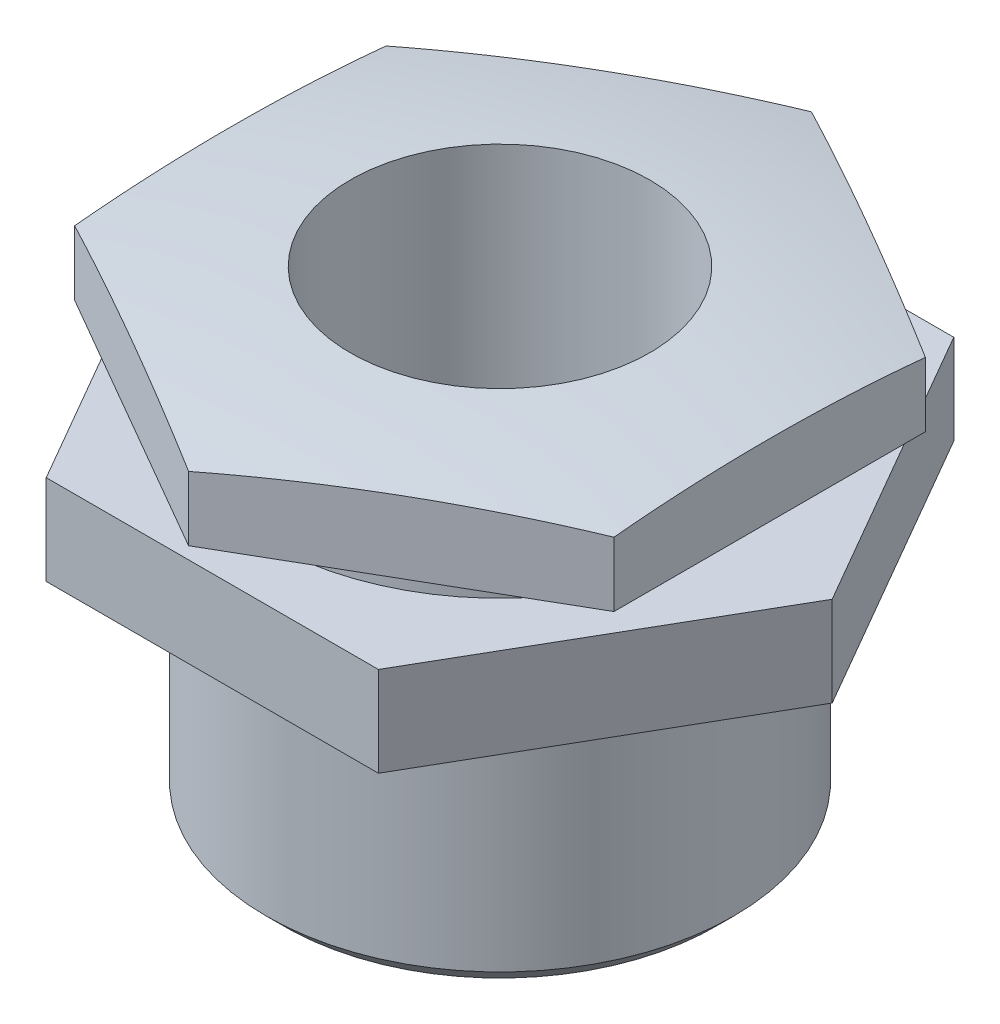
ISO-10303-21;
HEADER;
FILE_DESCRIPTION(('STEP AP214'),'2;1');
FILE_NAME('part.step','',(''),(''),'','','');
FILE_SCHEMA(('AUTOMOTIVE_DESIGN { 1 0 10303 214 1 1 1 1 }'));
ENDSEC;
DATA;
#1=APPLICATION_CONTEXT('core data for automotive mechanical design processes');
#2=APPLICATION_PROTOCOL_DEFINITION('international standard','automotive_design',2000,#1);
#3=PRODUCT_CONTEXT('',#1,'mechanical');
#4=PRODUCT('Part','Part','',(#3));
#5=PRODUCT_RELATED_PRODUCT_CATEGORY('part','',(#4));
#6=PRODUCT_DEFINITION_FORMATION('','',#4);
#7=PRODUCT_DEFINITION_CONTEXT('part definition',#1,'design');
#8=PRODUCT_DEFINITION('design','',#6,#7);
#9=PRODUCT_DEFINITION_SHAPE('','',#8);
#10=(LENGTH_UNIT() NAMED_UNIT(*) SI_UNIT(.MILLI.,.METRE.));
#11=(NAMED_UNIT(*) PLANE_ANGLE_UNIT() SI_UNIT($,.RADIAN.));
#12=(NAMED_UNIT(*) SI_UNIT($,.STERADIAN.) SOLID_ANGLE_UNIT());
#13=UNCERTAINTY_MEASURE_WITH_UNIT(LENGTH_MEASURE(1.E-05),#10,'distance_accuracy_value','');
#14=(GEOMETRIC_REPRESENTATION_CONTEXT(3) GLOBAL_UNCERTAINTY_ASSIGNED_CONTEXT((#13)) GLOBAL_UNIT_ASSIGNED_CONTEXT((#10,
#11,#12)) REPRESENTATION_CONTEXT('',''));
#15=CARTESIAN_POINT('',(0.,0.,0.));
#16=DIRECTION('',(0.,0.,1.));
#17=DIRECTION('',(1.,0.,0.));
#18=AXIS2_PLACEMENT_3D('',#15,#16,#17);
#19=CARTESIAN_POINT('',(0.,-7.,0.));
#20=DIRECTION('',(0.,-1.,0.));
#21=DIRECTION('',(0.,0.,-1.00000000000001));
#22=AXIS2_PLACEMENT_3D('',#19,#20,#21);
#23=PLANE('',#22);
#24=CARTESIAN_POINT('',(0.,-7.,0.));
#25=DIRECTION('',(0.,-1.,0.));
#26=DIRECTION('',(0.,0.,-1.00000000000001));
#27=AXIS2_PLACEMENT_3D('',#24,#25,#26);
#28=CIRCLE('',#27,13.);
#29=CARTESIAN_POINT('',(0.,-7.,-13.0000000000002));
#30=VERTEX_POINT('',#29);
#31=EDGE_CURVE('E129',#30,#30,#28,.T.);
#32=ORIENTED_EDGE('',*,*,#31,.F.);
#33=EDGE_LOOP('',(#32));
#34=FACE_BOUND('',#33,.T.);
#35=DIRECTION('',(1.00000000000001,0.,0.));
#36=VECTOR('',#35,1.);
#37=CARTESIAN_POINT('',(-8.50014503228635E-13,-7.,-16.));
#38=LINE('',#37,#36);
#39=CARTESIAN_POINT('',(-9.23760430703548,-7.,-16.0000000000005));
#40=VERTEX_POINT('',#39);
#41=CARTESIAN_POINT('',(9.23760430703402,-7.,-16.0000000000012));
#42=VERTEX_POINT('',#41);
#43=EDGE_CURVE('E126',#40,#42,#38,.T.);
#44=ORIENTED_EDGE('',*,*,#43,.T.);
#45=DIRECTION('',(0.500000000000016,0.,0.866025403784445));
#46=VECTOR('',#45,1.);
#47=CARTESIAN_POINT('',(13.8564064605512,-7.,-8.00000000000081));
#48=LINE('',#47,#46);
#49=CARTESIAN_POINT('',(18.4752086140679,-7.,-3.33066907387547E-13));
#50=VERTEX_POINT('',#49);
#51=EDGE_CURVE('E108',#42,#50,#48,.T.);
#52=ORIENTED_EDGE('',*,*,#51,.T.);
#53=DIRECTION('',(-0.5,0.,0.866025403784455));
#54=VECTOR('',#53,1.);
#55=CARTESIAN_POINT('',(13.8564064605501,-7.,7.99999999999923));
#56=LINE('',#55,#54);
#57=CARTESIAN_POINT('',(9.23760430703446,-7.,15.9999999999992));
#58=VERTEX_POINT('',#57);
#59=EDGE_CURVE('E255',#50,#58,#56,.T.);
#60=ORIENTED_EDGE('',*,*,#59,.T.);
#61=DIRECTION('',(-1.00000000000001,0.,0.));
#62=VECTOR('',#61,1.);
#63=CARTESIAN_POINT('',(-1.97758476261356E-13,-7.,15.9999999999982));
#64=LINE('',#63,#62);
#65=CARTESIAN_POINT('',(-9.23760430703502,-7.,16.0000000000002));
#66=VERTEX_POINT('',#65);
#67=EDGE_CURVE('E251',#58,#66,#64,.T.);
#68=ORIENTED_EDGE('',*,*,#67,.T.);
#69=DIRECTION('',(-0.500000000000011,0.,-0.866025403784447));
#70=VECTOR('',#69,1.);
#71=CARTESIAN_POINT('',(-13.8564064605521,-7.,7.99999999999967));
#72=LINE('',#71,#70);
#73=CARTESIAN_POINT('',(-18.4752086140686,-7.,-7.7715611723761E-13));
#74=VERTEX_POINT('',#73);
#75=EDGE_CURVE('E262',#66,#74,#72,.T.);
#76=ORIENTED_EDGE('',*,*,#75,.T.);
#77=DIRECTION('',(0.5,0.,-0.866025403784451));
#78=VECTOR('',#77,1.);
#79=CARTESIAN_POINT('',(-13.8564064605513,-7.,-8.00000000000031));
#80=LINE('',#79,#78);
#81=EDGE_CURVE('E127',#74,#40,#80,.T.);
#82=ORIENTED_EDGE('',*,*,#81,.T.);
#83=EDGE_LOOP('',(#44,#52,#60,#68,#76,#82));
#84=FACE_BOUND('',#83,.T.);
#85=ADVANCED_FACE('F17',(#34,#84),#23,.T.);
#86=CARTESIAN_POINT('',(0.,-2.,0.));
#87=DIRECTION('',(0.,-1.,0.));
#88=DIRECTION('',(0.,0.,-1.00000000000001));
#89=AXIS2_PLACEMENT_3D('',#86,#87,#88);
#90=PLANE('',#89);
#91=CARTESIAN_POINT('',(0.,-2.,0.));
#92=DIRECTION('',(0.,-1.,0.));
#93=DIRECTION('',(0.,0.,-1.00000000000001));
#94=AXIS2_PLACEMENT_3D('',#91,#92,#93);
#95=CIRCLE('',#94,13.);
#96=CARTESIAN_POINT('',(0.,-2.,-13.0000000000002));
#97=VERTEX_POINT('',#96);
#98=EDGE_CURVE('E235',#97,#97,#95,.T.);
#99=ORIENTED_EDGE('',*,*,#98,.T.);
#100=EDGE_LOOP('',(#99));
#101=FACE_BOUND('',#100,.T.);
#102=DIRECTION('',(0.500000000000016,0.,0.866025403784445));
#103=VECTOR('',#102,1.);
#104=CARTESIAN_POINT('',(4.35640646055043,-2.,-24.4544826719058));
#105=LINE('',#104,#103);
#106=CARTESIAN_POINT('',(9.237604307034,-2.,-16.0000000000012));
#107=VERTEX_POINT('',#106);
#108=CARTESIAN_POINT('',(18.475208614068,-2.,-3.33066907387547E-13));
#109=VERTEX_POINT('',#108);
#110=EDGE_CURVE('E33',#107,#109,#105,.T.);
#111=ORIENTED_EDGE('',*,*,#110,.F.);
#112=DIRECTION('',(1.00000000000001,0.,0.));
#113=VECTOR('',#112,1.);
#114=CARTESIAN_POINT('',(-19.0000000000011,-2.,-16.0000000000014));
#115=LINE('',#114,#113);
#116=CARTESIAN_POINT('',(-9.2376043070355,-2.,-16.0000000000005));
#117=VERTEX_POINT('',#116);
#118=EDGE_CURVE('E118',#117,#107,#115,.T.);
#119=ORIENTED_EDGE('',*,*,#118,.F.);
#120=DIRECTION('',(0.5,0.,-0.866025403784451));
#121=VECTOR('',#120,1.);
#122=CARTESIAN_POINT('',(-23.356406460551,-2.,8.45448267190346));
#123=LINE('',#122,#121);
#124=CARTESIAN_POINT('',(-18.4752086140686,-2.,-8.32667268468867E-13));
#125=VERTEX_POINT('',#124);
#126=EDGE_CURVE('E131',#125,#117,#123,.T.);
#127=ORIENTED_EDGE('',*,*,#126,.F.);
#128=DIRECTION('',(-0.500000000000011,0.,-0.866025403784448));
#129=VECTOR('',#128,1.);
#130=CARTESIAN_POINT('',(-4.35640646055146,-2.,24.4544826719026));
#131=LINE('',#130,#129);
#132=CARTESIAN_POINT('',(-9.23760430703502,-2.,16.0000000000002));
#133=VERTEX_POINT('',#132);
#134=EDGE_CURVE('E254',#133,#125,#131,.T.);
#135=ORIENTED_EDGE('',*,*,#134,.F.);
#136=DIRECTION('',(-1.00000000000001,0.,0.));
#137=VECTOR('',#136,1.);
#138=CARTESIAN_POINT('',(19.0000000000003,-2.,16.));
#139=LINE('',#138,#137);
#140=CARTESIAN_POINT('',(9.23760430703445,-2.,15.9999999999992));
#141=VERTEX_POINT('',#140);
#142=EDGE_CURVE('E250',#141,#133,#139,.T.);
#143=ORIENTED_EDGE('',*,*,#142,.F.);
#144=DIRECTION('',(-0.5,0.,0.866025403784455));
#145=VECTOR('',#144,1.);
#146=CARTESIAN_POINT('',(23.3564064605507,-2.,-8.45448267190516));
#147=LINE('',#146,#145);
#148=EDGE_CURVE('E39',#109,#141,#147,.T.);
#149=ORIENTED_EDGE('',*,*,#148,.F.);
#150=EDGE_LOOP('',(#111,#119,#127,#135,#143,#149));
#151=FACE_BOUND('',#150,.T.);
#152=ADVANCED_FACE('F116',(#101,#151),#90,.F.);
#153=CARTESIAN_POINT('',(-19.0000000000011,-2.,-16.0000000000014));
#154=DIRECTION('',(0.,0.,-1.00000000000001));
#155=DIRECTION('',(-1.00000000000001,0.,0.));
#156=AXIS2_PLACEMENT_3D('',#153,#154,#155);
#157=PLANE('',#156);
#158=ORIENTED_EDGE('',*,*,#118,.T.);
#159=DIRECTION('',(0.,-1.,0.));
#160=VECTOR('',#159,1.);
#161=CARTESIAN_POINT('',(9.237604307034,-2.,-16.0000000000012));
#162=LINE('',#161,#160);
#163=EDGE_CURVE('E105',#107,#42,#162,.T.);
#164=ORIENTED_EDGE('',*,*,#163,.T.);
#165=ORIENTED_EDGE('',*,*,#43,.F.);
#166=DIRECTION('',(0.,1.,0.));
#167=VECTOR('',#166,1.);
#168=CARTESIAN_POINT('',(-9.2376043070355,-2.,-16.0000000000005));
#169=LINE('',#168,#167);
#170=EDGE_CURVE('E125',#40,#117,#169,.T.);
#171=ORIENTED_EDGE('',*,*,#170,.T.);
#172=EDGE_LOOP('',(#158,#164,#165,#171));
#173=FACE_BOUND('',#172,.T.);
#174=ADVANCED_FACE('F123',(#173),#157,.T.);
#175=CARTESIAN_POINT('',(23.3564064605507,-2.,-8.45448267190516));
#176=DIRECTION('',(0.866025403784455,0.,0.5));
#177=DIRECTION('',(0.5,0.,-0.866025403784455));
#178=AXIS2_PLACEMENT_3D('',#175,#176,#177);
#179=PLANE('',#178);
#180=ORIENTED_EDGE('',*,*,#59,.F.);
#181=DIRECTION('',(0.,1.,0.));
#182=VECTOR('',#181,1.);
#183=CARTESIAN_POINT('',(18.475208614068,-2.,-3.33066907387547E-13));
#184=LINE('',#183,#182);
#185=EDGE_CURVE('E11',#50,#109,#184,.T.);
#186=ORIENTED_EDGE('',*,*,#185,.T.);
#187=ORIENTED_EDGE('',*,*,#148,.T.);
#188=DIRECTION('',(0.,1.,0.));
#189=VECTOR('',#188,1.);
#190=CARTESIAN_POINT('',(9.23760430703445,-2.,15.9999999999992));
#191=LINE('',#190,#189);
#192=EDGE_CURVE('E26',#58,#141,#191,.T.);
#193=ORIENTED_EDGE('',*,*,#192,.F.);
#194=EDGE_LOOP('',(#180,#186,#187,#193));
#195=FACE_BOUND('',#194,.T.);
#196=ADVANCED_FACE('F271',(#195),#179,.T.);
#197=CARTESIAN_POINT('',(19.0000000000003,-2.,16.));
#198=DIRECTION('',(0.,0.,1.00000000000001));
#199=DIRECTION('',(1.00000000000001,0.,0.));
#200=AXIS2_PLACEMENT_3D('',#197,#198,#199);
#201=PLANE('',#200);
#202=ORIENTED_EDGE('',*,*,#67,.F.);
#203=ORIENTED_EDGE('',*,*,#192,.T.);
#204=ORIENTED_EDGE('',*,*,#142,.T.);
#205=DIRECTION('',(0.,1.,0.));
#206=VECTOR('',#205,1.);
#207=CARTESIAN_POINT('',(-9.23760430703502,-2.,16.0000000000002));
#208=LINE('',#207,#206);
#209=EDGE_CURVE('E244',#66,#133,#208,.T.);
#210=ORIENTED_EDGE('',*,*,#209,.F.);
#211=EDGE_LOOP('',(#202,#203,#204,#210));
#212=FACE_BOUND('',#211,.T.);
#213=ADVANCED_FACE('F248',(#212),#201,.T.);
#214=CARTESIAN_POINT('',(-4.35640646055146,-2.,24.4544826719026));
#215=DIRECTION('',(-0.866025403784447,0.,0.500000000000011));
#216=DIRECTION('',(0.500000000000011,0.,0.866025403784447));
#217=AXIS2_PLACEMENT_3D('',#214,#215,#216);
#218=PLANE('',#217);
#219=ORIENTED_EDGE('',*,*,#75,.F.);
#220=ORIENTED_EDGE('',*,*,#209,.T.);
#221=ORIENTED_EDGE('',*,*,#134,.T.);
#222=DIRECTION('',(0.,1.,0.));
#223=VECTOR('',#222,1.);
#224=CARTESIAN_POINT('',(-18.4752086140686,-2.,-8.32667268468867E-13));
#225=LINE('',#224,#223);
#226=EDGE_CURVE('E241',#74,#125,#225,.T.);
#227=ORIENTED_EDGE('',*,*,#226,.F.);
#228=EDGE_LOOP('',(#219,#220,#221,#227));
#229=FACE_BOUND('',#228,.T.);
#230=ADVANCED_FACE('F269',(#229),#218,.T.);
#231=CARTESIAN_POINT('',(-23.356406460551,-2.,8.45448267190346));
#232=DIRECTION('',(-0.866025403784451,0.,-0.5));
#233=DIRECTION('',(-0.5,0.,0.866025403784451));
#234=AXIS2_PLACEMENT_3D('',#231,#232,#233);
#235=PLANE('',#234);
#236=ORIENTED_EDGE('',*,*,#81,.F.);
#237=ORIENTED_EDGE('',*,*,#226,.T.);
#238=ORIENTED_EDGE('',*,*,#126,.T.);
#239=ORIENTED_EDGE('',*,*,#170,.F.);
#240=EDGE_LOOP('',(#236,#237,#238,#239));
#241=FACE_BOUND('',#240,.T.);
#242=ADVANCED_FACE('F265',(#241),#235,.T.);
#243=CARTESIAN_POINT('',(0.,-21.,0.));
#244=DIRECTION('',(0.,1.,0.));
#245=DIRECTION('',(0.,0.,1.00000000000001));
#246=AXIS2_PLACEMENT_3D('',#243,#244,#245);
#247=CYLINDRICAL_SURFACE('',#246,13.);
#248=CARTESIAN_POINT('',(0.,0.,0.));
#249=DIRECTION('',(0.,-1.,0.));
#250=DIRECTION('',(0.,0.,-1.00000000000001));
#251=AXIS2_PLACEMENT_3D('',#248,#249,#250);
#252=CIRCLE('',#251,13.);
#253=CARTESIAN_POINT('',(0.,0.,-13.0000000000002));
#254=VERTEX_POINT('',#253);
#255=EDGE_CURVE('E135',#254,#254,#252,.T.);
#256=ORIENTED_EDGE('',*,*,#255,.T.);
#257=EDGE_LOOP('',(#256));
#258=FACE_BOUND('',#257,.T.);
#259=ORIENTED_EDGE('',*,*,#98,.F.);
#260=EDGE_LOOP('',(#259));
#261=FACE_BOUND('',#260,.T.);
#262=ADVANCED_FACE('F329',(#258,#261),#247,.T.);
#263=CARTESIAN_POINT('',(0.,0.,0.));
#264=DIRECTION('',(0.,-1.,0.));
#265=DIRECTION('',(0.,0.,-1.00000000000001));
#266=AXIS2_PLACEMENT_3D('',#263,#264,#265);
#267=PLANE('',#266);
#268=DIRECTION('',(0.,0.,1.00000000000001));
#269=VECTOR('',#268,1.);
#270=CARTESIAN_POINT('',(15.,0.,-3.60822483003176E-13));
#271=LINE('',#270,#269);
#272=CARTESIAN_POINT('',(15.,0.,-8.66025403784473));
#273=VERTEX_POINT('',#272);
#274=CARTESIAN_POINT('',(14.9999999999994,0.,8.66025403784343));
#275=VERTEX_POINT('',#274);
#276=EDGE_CURVE('E211',#273,#275,#271,.T.);
#277=ORIENTED_EDGE('',*,*,#276,.T.);
#278=DIRECTION('',(0.866025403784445,0.,-0.500000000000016));
#279=VECTOR('',#278,1.);
#280=CARTESIAN_POINT('',(-23.6769145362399,0.,30.9903810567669));
#281=LINE('',#280,#279);
#282=CARTESIAN_POINT('',(1.76941794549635E-13,0.,17.320508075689));
#283=VERTEX_POINT('',#282);
#284=EDGE_CURVE('E138',#283,#275,#281,.T.);
#285=ORIENTED_EDGE('',*,*,#284,.F.);
#286=DIRECTION('',(0.866025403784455,0.,0.5));
#287=VECTOR('',#286,1.);
#288=CARTESIAN_POINT('',(-38.6769145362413,0.,-5.0096189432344));
#289=LINE('',#288,#287);
#290=CARTESIAN_POINT('',(-15.0000000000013,0.,8.66025403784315));
#291=VERTEX_POINT('',#290);
#292=EDGE_CURVE('E174',#291,#283,#289,.T.);
#293=ORIENTED_EDGE('',*,*,#292,.F.);
#294=DIRECTION('',(0.,0.,1.00000000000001));
#295=VECTOR('',#294,1.);
#296=CARTESIAN_POINT('',(-15.0000000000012,0.,-36.0000000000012));
#297=LINE('',#296,#295);
#298=CARTESIAN_POINT('',(-15.,0.,-8.66025403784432));
#299=VERTEX_POINT('',#298);
#300=EDGE_CURVE('E173',#299,#291,#297,.T.);
#301=ORIENTED_EDGE('',*,*,#300,.F.);
#302=DIRECTION('',(-0.866025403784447,0.,0.500000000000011));
#303=VECTOR('',#302,1.);
#304=CARTESIAN_POINT('',(23.6769145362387,0.,-30.9903810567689));
#305=LINE('',#304,#303);
#306=CARTESIAN_POINT('',(-2.02962646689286E-13,0.,-17.3205080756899));
#307=VERTEX_POINT('',#306);
#308=EDGE_CURVE('E181',#307,#299,#305,.T.);
#309=ORIENTED_EDGE('',*,*,#308,.F.);
#310=DIRECTION('',(-0.866025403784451,0.,-0.5));
#311=VECTOR('',#310,1.);
#312=CARTESIAN_POINT('',(38.67691453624,0.,5.00961894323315));
#313=LINE('',#312,#311);
#314=EDGE_CURVE('E189',#273,#307,#313,.T.);
#315=ORIENTED_EDGE('',*,*,#314,.F.);
#316=EDGE_LOOP('',(#277,#285,#293,#301,#309,#315));
#317=FACE_BOUND('',#316,.T.);
#318=ORIENTED_EDGE('',*,*,#255,.F.);
#319=EDGE_LOOP('',(#318));
#320=FACE_BOUND('',#319,.T.);
#321=ADVANCED_FACE('F335',(#317,#320),#267,.T.);
#322=CARTESIAN_POINT('',(0.,-70.,0.));
#323=DIRECTION('',(0.,-1.,0.));
#324=DIRECTION('',(0.,0.,-1.00000000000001));
#325=AXIS2_PLACEMENT_3D('',#322,#323,#324);
#326=DEGENERATE_TOROIDAL_SURFACE('',#325,2.79534946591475,75.,.T.);
#327=CARTESIAN_POINT('',(0.,4.79550550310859,0.));
#328=DIRECTION('',(0.,-1.,0.));
#329=DIRECTION('',(0.,0.,-1.00000000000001));
#330=AXIS2_PLACEMENT_3D('',#327,#328,#329);
#331=CIRCLE('',#330,8.33);
#332=CARTESIAN_POINT('',(0.,4.79550550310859,-8.3300000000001));
#333=VERTEX_POINT('',#332);
#334=EDGE_CURVE('E120',#333,#333,#331,.T.);
#335=ORIENTED_EDGE('',*,*,#334,.T.);
#336=EDGE_LOOP('',(#335));
#337=FACE_BOUND('',#336,.T.);
#338=CARTESIAN_POINT('',(15.0001999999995,3.58000008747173,8.66013856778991));
#339=CARTESIAN_POINT('',(14.3661962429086,3.65225650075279,9.02618080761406));
#340=CARTESIAN_POINT('',(13.731383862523,3.71490206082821,9.39268990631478));
#341=CARTESIAN_POINT('',(12.4605968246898,3.82144104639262,10.1263791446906));
#342=CARTESIAN_POINT('',(11.8246222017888,3.86533502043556,10.4935592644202));
#343=CARTESIAN_POINT('',(10.5516700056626,3.93485869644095,11.2284985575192));
#344=CARTESIAN_POINT('',(9.91469212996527,3.96048097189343,11.5962579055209));
#345=CARTESIAN_POINT('',(8.64038290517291,3.99377012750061,12.3319806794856));
#346=CARTESIAN_POINT('',(8.0030515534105,4.00143687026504,12.6999441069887));
#347=CARTESIAN_POINT('',(6.73250124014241,3.99893533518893,13.433496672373));
#348=CARTESIAN_POINT('',(6.09928215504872,3.98888128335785,13.7990858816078));
#349=CARTESIAN_POINT('',(4.83326148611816,3.95101539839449,14.5300232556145));
#350=CARTESIAN_POINT('',(4.20045990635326,3.92320339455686,14.8953714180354));
#351=CARTESIAN_POINT('',(2.30355693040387,3.8126107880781,15.9905488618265));
#352=CARTESIAN_POINT('',(1.04048528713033,3.70267311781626,16.7197836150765));
#353=CARTESIAN_POINT('',(-0.531249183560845,3.51798507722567,17.6272249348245));
#354=CARTESIAN_POINT('',(-0.843264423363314,3.47895657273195,17.8073670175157));
#355=CARTESIAN_POINT('',(-1.46681478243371,3.39616721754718,18.1673739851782));
#356=CARTESIAN_POINT('',(-1.7783499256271,3.35240661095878,18.3472388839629));
#357=CARTESIAN_POINT('',(-2.40137927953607,3.26002983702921,18.7069450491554));
#358=CARTESIAN_POINT('',(-2.71287264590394,3.21140609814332,18.8867858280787));
#359=CARTESIAN_POINT('',(-3.33528195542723,3.10931500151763,19.246134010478));
#360=CARTESIAN_POINT('',(-3.64619786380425,3.05584736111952,19.4256413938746));
#361=CARTESIAN_POINT('',(-3.95678564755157,2.99993764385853,19.6049593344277));
#362=B_SPLINE_CURVE_WITH_KNOTS('',3,(#338,#339,#340,#341,#342,#343,#344,#345,#346,#347,#348,
#349,#350,#351,#352,#353,#354,#355,#356,#357,#358,#359,#360,#361),.UNSPECIFIED.,.F.,.F.,(4,2,2,
2,2,2,2,2,2,2,2,4),(0.,2.20683979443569,4.41361502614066,6.62128668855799,8.8289752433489,
11.0224853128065,13.2160164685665,17.6014452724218,18.6886097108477,19.7757180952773,
20.8645461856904,21.9534378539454),.UNSPECIFIED.);
#363=CARTESIAN_POINT('',(14.9999999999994,3.58002288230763,8.66025403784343));
#364=VERTEX_POINT('',#363);
#365=CARTESIAN_POINT('',(1.57859836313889E-13,3.58002288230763,17.320508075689));
#366=VERTEX_POINT('',#365);
#367=EDGE_CURVE('E140',#364,#366,#362,.T.);
#368=ORIENTED_EDGE('',*,*,#367,.F.);
#369=CARTESIAN_POINT('',(15.,4.00031422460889,-3.60822483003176E-13));
#370=CARTESIAN_POINT('',(15.,4.00031432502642,0.631994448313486));
#371=CARTESIAN_POINT('',(14.9999999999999,3.9937331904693,1.26398989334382));
#372=CARTESIAN_POINT('',(14.9999999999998,3.9673349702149,2.5277057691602));
#373=CARTESIAN_POINT('',(14.9999999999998,3.94751762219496,3.15942619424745));
#374=CARTESIAN_POINT('',(14.9999999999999,3.86792472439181,5.0538385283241));
#375=CARTESIAN_POINT('',(14.9999999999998,3.78800830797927,6.31575624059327));
#376=CARTESIAN_POINT('',(14.9999999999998,3.57196529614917,8.83615635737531));
#377=CARTESIAN_POINT('',(14.9999999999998,3.43577724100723,10.0946334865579));
#378=CARTESIAN_POINT('',(14.9999999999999,3.10483486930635,12.6041008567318));
#379=CARTESIAN_POINT('',(15.,2.91007275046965,13.8550900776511));
#380=CARTESIAN_POINT('',(15.,2.49495812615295,16.1553257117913));
#381=CARTESIAN_POINT('',(14.9999999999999,2.28310023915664,17.2061115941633));
#382=CARTESIAN_POINT('',(14.9999999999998,1.81585815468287,19.2980575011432));
#383=CARTESIAN_POINT('',(14.9999999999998,1.56047105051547,20.3392168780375));
#384=CARTESIAN_POINT('',(14.9999999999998,1.00599329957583,22.4100667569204));
#385=CARTESIAN_POINT('',(14.9999999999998,0.706893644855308,23.4397548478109));
#386=CARTESIAN_POINT('',(14.9999999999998,0.0651350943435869,25.4855740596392));
#387=CARTESIAN_POINT('',(14.9999999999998,-0.277527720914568,26.5017039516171));
#388=CARTESIAN_POINT('',(14.9999999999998,-1.00629015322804,28.5190284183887));
#389=CARTESIAN_POINT('',(14.9999999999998,-1.39241829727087,29.5202126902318));
#390=CARTESIAN_POINT('',(14.9999999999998,-2.2074554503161,31.5051286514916));
#391=CARTESIAN_POINT('',(14.9999999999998,-2.63636854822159,32.4888586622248));
#392=CARTESIAN_POINT('',(14.9999999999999,-3.53622289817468,34.4367248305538));
#393=CARTESIAN_POINT('',(15.,-4.00715773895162,35.4008639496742));
#394=CARTESIAN_POINT('',(14.9999999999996,-4.99038336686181,37.3079382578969));
#395=CARTESIAN_POINT('',(14.9999999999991,-5.50267810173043,38.2508714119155));
#396=CARTESIAN_POINT('',(14.9999999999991,-6.56262418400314,40.1047458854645));
#397=CARTESIAN_POINT('',(14.9999999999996,-7.10989214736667,41.0159064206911));
#398=CARTESIAN_POINT('',(15.,-8.24319169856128,42.8139164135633));
#399=CARTESIAN_POINT('',(14.9999999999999,-8.82922699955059,43.7007635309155));
#400=CARTESIAN_POINT('',(14.9999999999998,-10.0389202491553,45.4483074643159));
#401=CARTESIAN_POINT('',(14.9999999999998,-10.6625750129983,46.3090064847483));
#402=CARTESIAN_POINT('',(14.9999999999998,-11.946482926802,48.0027858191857));
#403=CARTESIAN_POINT('',(14.9999999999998,-12.6067396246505,48.8358634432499));
#404=CARTESIAN_POINT('',(14.9999999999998,-13.9624789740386,50.4725952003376));
#405=CARTESIAN_POINT('',(14.9999999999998,-14.6579546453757,51.2762551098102));
#406=CARTESIAN_POINT('',(14.9999999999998,-16.0829692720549,52.852823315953));
#407=CARTESIAN_POINT('',(14.9999999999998,-16.8125115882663,53.6257285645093));
#408=CARTESIAN_POINT('',(14.9999999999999,-19.0501004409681,55.8959037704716));
#409=CARTESIAN_POINT('',(15.0000000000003,-20.6075177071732,57.3451266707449));
#410=CARTESIAN_POINT('',(15.0000000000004,-23.8050198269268,60.0722877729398));
#411=CARTESIAN_POINT('',(15.,-25.4424505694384,61.3533501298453));
#412=CARTESIAN_POINT('',(14.9999999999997,-28.819729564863,63.7726025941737));
#413=CARTESIAN_POINT('',(14.9999999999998,-30.5595761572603,64.9107950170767));
#414=CARTESIAN_POINT('',(14.9999999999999,-34.1290718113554,67.0359625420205));
#415=CARTESIAN_POINT('',(14.9999999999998,-35.9587134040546,68.0229501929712));
#416=CARTESIAN_POINT('',(14.9999999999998,-39.6948875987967,69.8387450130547));
#417=CARTESIAN_POINT('',(14.9999999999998,-41.6014203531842,70.6675518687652));
#418=CARTESIAN_POINT('',(14.9999999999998,-45.4718397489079,72.1587438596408));
#419=CARTESIAN_POINT('',(14.9999999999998,-47.4355347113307,72.8216265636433));
#420=CARTESIAN_POINT('',(14.9999999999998,-51.4118112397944,73.9794956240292));
#421=CARTESIAN_POINT('',(14.9999999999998,-53.4243926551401,74.47448249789));
#422=CARTESIAN_POINT('',(14.9999999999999,-57.4841725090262,75.2930324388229));
#423=CARTESIAN_POINT('',(15.,-59.5313718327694,75.6165911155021));
#424=CARTESIAN_POINT('',(14.9999999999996,-63.6457624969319,76.0899522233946));
#425=CARTESIAN_POINT('',(14.9999999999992,-65.7129538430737,76.2397546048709));
#426=CARTESIAN_POINT('',(14.9999999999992,-69.8510861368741,76.3644860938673));
#427=CARTESIAN_POINT('',(14.9999999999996,-71.9220232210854,76.3395434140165));
#428=CARTESIAN_POINT('',(15.,-76.054431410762,76.1152654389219));
#429=CARTESIAN_POINT('',(14.9999999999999,-78.1159025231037,75.9159302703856));
#430=CARTESIAN_POINT('',(14.9999999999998,-82.2146658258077,75.344298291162));
#431=CARTESIAN_POINT('',(14.9999999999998,-84.2519586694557,74.9720061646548));
#432=CARTESIAN_POINT('',(14.9999999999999,-88.2879393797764,74.0571202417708));
#433=CARTESIAN_POINT('',(15.,-90.2866272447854,73.5145264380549));
#434=CARTESIAN_POINT('',(15.,-94.2310510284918,72.262955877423));
#435=CARTESIAN_POINT('',(14.9999999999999,-96.1767908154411,71.5539913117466));
#436=CARTESIAN_POINT('',(14.9999999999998,-100.001648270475,69.9747242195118));
#437=CARTESIAN_POINT('',(14.9999999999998,-101.880765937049,69.1044216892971));
#438=CARTESIAN_POINT('',(14.9999999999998,-105.559139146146,67.2086358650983));
#439=CARTESIAN_POINT('',(14.9999999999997,-107.358391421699,66.1831462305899));
#440=CARTESIAN_POINT('',(14.9999999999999,-110.864130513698,63.9844043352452));
#441=CARTESIAN_POINT('',(15.0000000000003,-112.570617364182,62.8111521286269));
#442=CARTESIAN_POINT('',(15.0000000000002,-115.879819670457,60.3244049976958));
#443=CARTESIAN_POINT('',(14.9999999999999,-117.482484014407,59.0108418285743));
#444=CARTESIAN_POINT('',(14.9999999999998,-119.798974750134,56.943234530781));
#445=CARTESIAN_POINT('',(14.9999999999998,-120.556650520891,56.2377197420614));
#446=CARTESIAN_POINT('',(14.9999999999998,-122.041618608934,54.7954443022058));
#447=CARTESIAN_POINT('',(14.9999999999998,-122.768913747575,54.0586865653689));
#448=CARTESIAN_POINT('',(14.9999999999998,-124.191889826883,52.5551899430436));
#449=CARTESIAN_POINT('',(14.9999999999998,-124.887568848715,51.7884492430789));
#450=CARTESIAN_POINT('',(14.9999999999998,-126.246007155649,50.2264591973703));
#451=CARTESIAN_POINT('',(14.9999999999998,-126.90876948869,49.431212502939));
#452=CARTESIAN_POINT('',(14.9999999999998,-128.20034225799,47.8135018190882));
#453=CARTESIAN_POINT('',(14.9999999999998,-128.829149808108,46.9910355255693));
#454=CARTESIAN_POINT('',(14.9999999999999,-130.051613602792,45.3204986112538));
#455=CARTESIAN_POINT('',(15.,-130.645273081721,44.472430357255));
#456=CARTESIAN_POINT('',(15.,-131.797774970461,42.7502175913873));
#457=CARTESIAN_POINT('',(14.9999999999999,-132.356536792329,41.8760191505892));
#458=CARTESIAN_POINT('',(14.9999999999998,-133.436806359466,40.1050108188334));
#459=CARTESIAN_POINT('',(14.9999999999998,-133.958317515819,39.2082030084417));
#460=CARTESIAN_POINT('',(14.9999999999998,-134.963337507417,37.3934124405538));
#461=CARTESIAN_POINT('',(14.9999999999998,-135.446842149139,36.4754273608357));
#462=CARTESIAN_POINT('',(14.9999999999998,-136.374971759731,34.6201146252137));
#463=CARTESIAN_POINT('',(14.9999999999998,-136.819600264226,33.6827887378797));
#464=CARTESIAN_POINT('',(14.9999999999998,-137.669197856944,31.7907483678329));
#465=CARTESIAN_POINT('',(14.9999999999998,-138.07418146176,30.8360404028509));
#466=CARTESIAN_POINT('',(14.9999999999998,-138.844078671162,28.9107031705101));
#467=CARTESIAN_POINT('',(14.9999999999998,-139.208995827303,27.9400753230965));
#468=CARTESIAN_POINT('',(14.9999999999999,-139.898359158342,25.9845832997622));
#469=CARTESIAN_POINT('',(14.9999999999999,-140.222806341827,24.9997194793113));
#470=CARTESIAN_POINT('',(14.9999999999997,-140.830959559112,23.0174965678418));
#471=CARTESIAN_POINT('',(14.9999999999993,-141.114665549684,22.0201374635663));
#472=CARTESIAN_POINT('',(14.9999999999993,-141.643668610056,20.0054655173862));
#473=CARTESIAN_POINT('',(14.9999999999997,-141.888587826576,18.9880535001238));
#474=CARTESIAN_POINT('',(14.9999999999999,-142.336985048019,16.9441482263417));
#475=CARTESIAN_POINT('',(14.9999999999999,-142.540463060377,15.9176549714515));
#476=CARTESIAN_POINT('',(14.9999999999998,-142.906447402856,13.8573572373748));
#477=CARTESIAN_POINT('',(14.9999999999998,-143.068951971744,12.8235524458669));
#478=CARTESIAN_POINT('',(14.9999999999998,-143.353815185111,10.7504417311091));
#479=CARTESIAN_POINT('',(14.9999999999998,-143.476173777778,9.71113580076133));
#480=CARTESIAN_POINT('',(14.9999999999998,-143.682125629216,7.62705584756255));
#481=CARTESIAN_POINT('',(14.9999999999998,-143.765657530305,6.58227579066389));
#482=CARTESIAN_POINT('',(14.9999999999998,-143.895105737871,4.4903840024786));
#483=CARTESIAN_POINT('',(14.9999999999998,-143.94102124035,3.44327222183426));
#484=CARTESIAN_POINT('',(14.9999999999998,-143.996403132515,1.34791317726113));
#485=CARTESIAN_POINT('',(14.9999999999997,-144.005863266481,0.299665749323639));
#486=CARTESIAN_POINT('',(14.9999999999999,-143.988605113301,-1.79654615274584));
#487=CARTESIAN_POINT('',(15.0000000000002,-143.9618861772,-2.84451062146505));
#488=CARTESIAN_POINT('',(15.0000000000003,-143.865810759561,-5.07076057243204));
#489=CARTESIAN_POINT('',(14.9999999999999,-143.791508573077,-6.24883808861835));
#490=CARTESIAN_POINT('',(14.9999999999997,-143.594094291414,-8.60092240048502));
#491=CARTESIAN_POINT('',(14.9999999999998,-143.47098209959,-9.77492918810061));
#492=CARTESIAN_POINT('',(14.9999999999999,-143.174067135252,-12.1163453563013));
#493=CARTESIAN_POINT('',(14.9999999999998,-143.000272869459,-13.2837558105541));
#494=CARTESIAN_POINT('',(14.9999999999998,-142.600669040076,-15.60965807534));
#495=CARTESIAN_POINT('',(14.9999999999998,-142.374859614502,-16.7681499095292));
#496=CARTESIAN_POINT('',(14.9999999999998,-141.870962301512,-19.0716170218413));
#497=CARTESIAN_POINT('',(14.9999999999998,-141.59296576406,-20.2166122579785));
#498=CARTESIAN_POINT('',(14.9999999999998,-140.984243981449,-22.4925181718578));
#499=CARTESIAN_POINT('',(14.9999999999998,-140.653518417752,-23.6234287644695));
#500=CARTESIAN_POINT('',(14.9999999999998,-139.93949988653,-25.8686502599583));
#501=CARTESIAN_POINT('',(14.9999999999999,-139.556202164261,-26.9829596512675));
#502=CARTESIAN_POINT('',(14.9999999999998,-138.737552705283,-29.1922852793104));
#503=CARTESIAN_POINT('',(14.9999999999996,-138.302201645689,-30.2873017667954));
#504=CARTESIAN_POINT('',(14.9999999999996,-137.406210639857,-32.3942767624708));
#505=CARTESIAN_POINT('',(14.9999999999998,-136.948386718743,-33.4074338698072));
#506=CARTESIAN_POINT('',(14.9999999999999,-135.987766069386,-35.4123283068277));
#507=CARTESIAN_POINT('',(14.9999999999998,-135.484964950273,-36.4040635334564));
#508=CARTESIAN_POINT('',(14.9999999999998,-134.435420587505,-38.363797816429));
#509=CARTESIAN_POINT('',(14.9999999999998,-133.888684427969,-39.3318006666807));
#510=CARTESIAN_POINT('',(14.9999999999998,-132.752166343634,-41.2423366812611));
#511=CARTESIAN_POINT('',(14.9999999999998,-132.162379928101,-42.1848671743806));
#512=CARTESIAN_POINT('',(14.9999999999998,-130.940489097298,-44.0431051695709));
#513=CARTESIAN_POINT('',(14.9999999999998,-130.308353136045,-44.9587919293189));
#514=CARTESIAN_POINT('',(14.9999999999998,-129.003400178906,-46.7607102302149));
#515=CARTESIAN_POINT('',(14.9999999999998,-128.330583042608,-47.6469416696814));
#516=CARTESIAN_POINT('',(14.9999999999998,-126.945629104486,-49.3880870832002));
#517=CARTESIAN_POINT('',(14.9999999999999,-126.233493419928,-50.2430019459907));
#518=CARTESIAN_POINT('',(14.9999999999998,-124.771312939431,-51.9197725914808));
#519=CARTESIAN_POINT('',(14.9999999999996,-124.021268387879,-52.7416285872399));
#520=CARTESIAN_POINT('',(14.9999999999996,-122.533547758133,-54.299521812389));
#521=CARTESIAN_POINT('',(14.9999999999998,-121.798107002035,-55.0376954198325));
#522=CARTESIAN_POINT('',(14.9999999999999,-120.296546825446,-56.4822831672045));
#523=CARTESIAN_POINT('',(14.9999999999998,-119.530424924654,-57.1886947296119));
#524=CARTESIAN_POINT('',(14.9999999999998,-117.969038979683,-58.5683119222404));
#525=CARTESIAN_POINT('',(14.9999999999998,-117.173779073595,-59.241522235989));
#526=CARTESIAN_POINT('',(14.9999999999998,-115.555359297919,-60.5536869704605));
#527=CARTESIAN_POINT('',(14.9999999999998,-114.732196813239,-61.1926381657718));
#528=CARTESIAN_POINT('',(14.9999999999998,-113.059996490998,-62.4347017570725));
#529=CARTESIAN_POINT('',(14.9999999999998,-112.210973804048,-63.0378345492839));
#530=CARTESIAN_POINT('',(14.9999999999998,-110.488047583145,-64.2076210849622));
#531=CARTESIAN_POINT('',(14.9999999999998,-109.614141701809,-64.7742713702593));
#532=CARTESIAN_POINT('',(14.9999999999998,-107.843145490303,-65.8699676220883));
#533=CARTESIAN_POINT('',(14.9999999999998,-106.946057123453,-66.3990167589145));
#534=CARTESIAN_POINT('',(14.9999999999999,-105.130235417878,-67.4186206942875));
#535=CARTESIAN_POINT('',(15.,-104.211500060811,-67.9091718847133));
#536=CARTESIAN_POINT('',(15.0000000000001,-101.435147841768,-69.31668444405));
#537=CARTESIAN_POINT('',(14.9999999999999,-99.5476277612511,-70.1755370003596));
#538=CARTESIAN_POINT('',(14.9999999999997,-95.7071564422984,-71.7308933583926));
#539=CARTESIAN_POINT('',(14.9999999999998,-93.7542056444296,-72.4273982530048));
#540=CARTESIAN_POINT('',(14.9999999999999,-89.796229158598,-73.6533291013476));
#541=CARTESIAN_POINT('',(14.9999999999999,-87.7911975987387,-74.1827361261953));
#542=CARTESIAN_POINT('',(14.9999999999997,-83.743639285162,-75.0705267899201));
#543=CARTESIAN_POINT('',(14.9999999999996,-81.7011124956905,-75.428910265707));
#544=CARTESIAN_POINT('',(14.9999999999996,-77.5954671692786,-75.9717880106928));
#545=CARTESIAN_POINT('',(14.9999999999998,-75.5323750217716,-76.1564818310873));
#546=CARTESIAN_POINT('',(14.9999999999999,-71.3979682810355,-76.3513699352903));
#547=CARTESIAN_POINT('',(14.9999999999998,-69.3266536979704,-76.3615644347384));
#548=CARTESIAN_POINT('',(14.9999999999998,-65.1905745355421,-76.2073840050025));
#549=CARTESIAN_POINT('',(15.,-63.1258098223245,-76.0430126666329));
#550=CARTESIAN_POINT('',(14.9999999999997,-59.0174724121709,-75.5408796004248));
#551=CARTESIAN_POINT('',(14.9999999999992,-56.9738997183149,-75.2031178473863));
#552=CARTESIAN_POINT('',(14.9999999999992,-52.9228861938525,-74.356701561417));
#553=CARTESIAN_POINT('',(14.9999999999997,-50.9154381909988,-73.8480813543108));
#554=CARTESIAN_POINT('',(15.,-46.9505165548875,-72.663561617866));
#555=CARTESIAN_POINT('',(14.9999999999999,-44.9930429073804,-71.9876621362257));
#556=CARTESIAN_POINT('',(14.9999999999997,-41.142021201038,-70.473431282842));
#557=CARTESIAN_POINT('',(14.9999999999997,-39.248471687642,-69.6351036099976));
#558=CARTESIAN_POINT('',(14.9999999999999,-35.5386706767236,-67.8019741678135));
#559=CARTESIAN_POINT('',(15.0000000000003,-33.7224191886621,-66.8071723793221));
#560=CARTESIAN_POINT('',(15.0000000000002,-30.1796591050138,-64.6679628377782));
#561=CARTESIAN_POINT('',(14.9999999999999,-28.4531759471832,-63.5235129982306));
#562=CARTESIAN_POINT('',(14.9999999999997,-25.1024667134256,-61.0931549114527));
#563=CARTESIAN_POINT('',(14.9999999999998,-23.478240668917,-59.80724662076));
#564=CARTESIAN_POINT('',(14.9999999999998,-21.1276750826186,-57.7796626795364));
#565=CARTESIAN_POINT('',(14.9999999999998,-20.358333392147,-57.0872299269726));
#566=CARTESIAN_POINT('',(14.9999999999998,-18.8494913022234,-55.6706179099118));
#567=CARTESIAN_POINT('',(14.9999999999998,-18.1099881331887,-54.9464416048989));
#568=CARTESIAN_POINT('',(14.9999999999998,-16.6620532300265,-53.4675619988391));
#569=CARTESIAN_POINT('',(14.9999999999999,-15.9536243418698,-52.7128559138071));
#570=CARTESIAN_POINT('',(14.9999999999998,-14.5691935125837,-51.1743864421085));
#571=CARTESIAN_POINT('',(14.9999999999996,-13.8931885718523,-50.3906257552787));
#572=CARTESIAN_POINT('',(14.9999999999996,-12.5738214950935,-48.7943034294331));
#573=CARTESIAN_POINT('',(14.9999999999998,-11.9305049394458,-47.9817041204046));
#574=CARTESIAN_POINT('',(14.9999999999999,-10.6786728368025,-46.3302462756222));
#575=CARTESIAN_POINT('',(14.9999999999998,-10.0701540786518,-45.4913901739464));
#576=CARTESIAN_POINT('',(14.9999999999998,-8.88884081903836,-43.7887700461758));
#577=CARTESIAN_POINT('',(14.9999999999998,-8.31604979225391,-42.9250036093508));
#578=CARTESIAN_POINT('',(14.9999999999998,-7.2072779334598,-41.174272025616));
#579=CARTESIAN_POINT('',(14.9999999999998,-6.67129371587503,-40.2873090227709));
#580=CARTESIAN_POINT('',(14.9999999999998,-5.63694142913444,-38.4916532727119));
#581=CARTESIAN_POINT('',(14.9999999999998,-5.13857533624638,-37.5829593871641));
#582=CARTESIAN_POINT('',(14.9999999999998,-4.18033944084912,-35.7456024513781));
#583=CARTESIAN_POINT('',(14.9999999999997,-3.72046614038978,-34.8169412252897));
#584=CARTESIAN_POINT('',(14.9999999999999,-2.83984962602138,-32.9411798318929));
#585=CARTESIAN_POINT('',(15.0000000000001,-2.41910881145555,-31.9940785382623));
#586=CARTESIAN_POINT('',(14.9999999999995,-1.61743161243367,-30.0832783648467));
#587=CARTESIAN_POINT('',(14.9999999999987,-1.23649170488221,-29.1195809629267));
#588=CARTESIAN_POINT('',(14.9999999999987,-0.512649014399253,-27.1712827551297));
#589=CARTESIAN_POINT('',(14.9999999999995,-0.169993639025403,-26.1865900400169));
#590=CARTESIAN_POINT('',(15.0000000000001,0.474222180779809,-24.2038543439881));
#591=CARTESIAN_POINT('',(14.9999999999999,0.775782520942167,-23.205811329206));
#592=CARTESIAN_POINT('',(14.9999999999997,1.33765069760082,-21.1981137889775));
#593=CARTESIAN_POINT('',(14.9999999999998,1.59795576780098,-20.1884584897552));
#594=CARTESIAN_POINT('',(14.9999999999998,2.07733227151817,-18.1594232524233));
#595=CARTESIAN_POINT('',(14.9999999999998,2.29640405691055,-17.1400433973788));
#596=CARTESIAN_POINT('',(14.9999999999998,2.69338272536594,-15.0946940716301));
#597=CARTESIAN_POINT('',(14.9999999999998,2.87134304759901,-14.0687349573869));
#598=CARTESIAN_POINT('',(14.9999999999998,3.18714019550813,-12.0106478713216));
#599=CARTESIAN_POINT('',(14.9999999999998,3.32497605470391,-10.9785197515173));
#600=CARTESIAN_POINT('',(14.9999999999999,3.56152931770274,-8.91018870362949));
#601=CARTESIAN_POINT('',(15.,3.66026073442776,-7.8739873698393));
#602=CARTESIAN_POINT('',(14.9999999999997,3.82003466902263,-5.79876807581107));
#603=CARTESIAN_POINT('',(14.9999999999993,3.88108028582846,-4.75975035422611));
#604=CARTESIAN_POINT('',(14.9999999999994,3.9494820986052,-3.10025947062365));
#605=CARTESIAN_POINT('',(14.9999999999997,3.96856482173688,-2.48024226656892));
#606=CARTESIAN_POINT('',(15.,3.99397868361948,-1.24015030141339));
#607=CARTESIAN_POINT('',(15.,4.00031412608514,-0.62007563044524));
#608=CARTESIAN_POINT('',(15.,4.00031422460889,-3.60822483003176E-13));
#609=B_SPLINE_CURVE_WITH_KNOTS('',3,(#369,#370,#371,#372,#373,#374,#375,#376,#377,#378,#379,
#380,#381,#382,#383,#384,#385,#386,#387,#388,#389,#390,#391,#392,#393,#394,#395,#396,#397,#398,
#399,#400,#401,#402,#403,#404,#405,#406,#407,#408,#409,#410,#411,#412,#413,#414,#415,#416,#417,
#418,#419,#420,#421,#422,#423,#424,#425,#426,#427,#428,#429,#430,#431,#432,#433,#434,#435,#436,
#437,#438,#439,#440,#441,#442,#443,#444,#445,#446,#447,#448,#449,#450,#451,#452,#453,#454,#455,
#456,#457,#458,#459,#460,#461,#462,#463,#464,#465,#466,#467,#468,#469,#470,#471,#472,#473,#474,
#475,#476,#477,#478,#479,#480,#481,#482,#483,#484,#485,#486,#487,#488,#489,#490,#491,#492,#493,
#494,#495,#496,#497,#498,#499,#500,#501,#502,#503,#504,#505,#506,#507,#508,#509,#510,#511,#512,
#513,#514,#515,#516,#517,#518,#519,#520,#521,#522,#523,#524,#525,#526,#527,#528,#529,#530,#531,
#532,#533,#534,#535,#536,#537,#538,#539,#540,#541,#542,#543,#544,#545,#546,#547,#548,#549,#550,
#551,#552,#553,#554,#555,#556,#557,#558,#559,#560,#561,#562,#563,#564,#565,#566,#567,#568,#569,
#570,#571,#572,#573,#574,#575,#576,#577,#578,#579,#580,#581,#582,#583,#584,#585,#586,#587,#588,
#589,#590,#591,#592,#593,#594,#595,#596,#597,#598,#599,#600,#601,#602,#603,#604,#605,#606,#607,
#608),.UNSPECIFIED.,.T.,.F.,(4,2,2,2,2,2,2,2,2,2,2,2,2,2,2,2,2,2,2,2,2,2,2,2,2,2,2,2,2,2,2,2,2,
2,2,2,2,2,2,2,2,2,2,2,2,2,2,2,2,2,2,2,2,2,2,2,2,2,2,2,2,2,2,2,2,2,2,2,2,2,2,2,2,2,2,2,2,2,2,2,2,
2,2,2,2,2,2,2,2,2,2,2,2,2,2,2,2,2,2,2,2,2,2,2,2,2,2,2,2,2,2,2,2,2,2,2,2,2,2,4),(0.,
1.8959447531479,3.79192708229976,7.5839674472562,11.3801604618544,15.1768593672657,
18.3917678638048,21.6068911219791,24.8226778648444,28.038754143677,31.2569536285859,
34.4754609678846,37.6934780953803,40.9118027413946,44.0994632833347,47.2874295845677,
50.4751263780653,53.6631327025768,56.8505096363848,60.0382016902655,66.4116697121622,
72.6414991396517,78.8712275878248,85.1004387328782,91.3296622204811,97.5399756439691,
103.750269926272,109.960723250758,116.171178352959,122.377077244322,128.582971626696,
134.788697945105,140.994424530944,147.19969651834,153.404968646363,159.610494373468,
165.816017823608,172.024573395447,175.129690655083,178.234518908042,181.339535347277,
184.444263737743,187.54925561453,190.653961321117,193.765589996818,196.876933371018,
199.988619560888,203.100022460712,206.210281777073,209.32026517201,212.430171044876,
215.54008021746,218.678634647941,221.817188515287,224.955877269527,228.094570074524,
231.23820622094,234.381909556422,237.526152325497,240.670451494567,244.210719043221,
247.750993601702,251.290674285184,254.830345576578,258.363877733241,261.89743123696,
265.431304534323,268.965131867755,272.299418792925,275.634031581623,278.968107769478,
282.302532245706,285.639468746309,288.976416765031,292.313270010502,295.650101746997,
298.775191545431,301.900534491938,305.025435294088,308.150629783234,311.274027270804,
314.397720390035,317.521149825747,320.644871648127,326.858012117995,333.071110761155,
339.284912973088,345.498721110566,351.705381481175,357.912034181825,364.118559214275,
370.325085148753,376.530364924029,382.735642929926,388.940779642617,395.145917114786,
401.352803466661,407.559691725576,410.664122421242,413.768264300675,416.872689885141,
419.976827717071,423.085181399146,426.193247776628,429.301615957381,432.409697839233,
435.517942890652,438.625905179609,441.734057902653,444.841935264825,447.968858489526,
451.095789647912,454.22293038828,457.350044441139,460.47307051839,463.596171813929,
466.718152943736,469.839877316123,471.700694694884,473.56088372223),.UNSPECIFIED.);
#610=CARTESIAN_POINT('',(15.,3.58002288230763,-8.66025403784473));
#611=VERTEX_POINT('',#610);
#612=EDGE_CURVE('E206',#611,#364,#609,.T.);
#613=ORIENTED_EDGE('',*,*,#612,.F.);
#614=CARTESIAN_POINT('',(-3.95755026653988,2.9998,-19.6054007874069));
#615=CARTESIAN_POINT('',(-3.17311352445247,3.14105063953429,-19.1525060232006));
#616=CARTESIAN_POINT('',(-2.38659626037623,3.26666450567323,-18.698410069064));
#617=CARTESIAN_POINT('',(-0.810450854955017,3.48745290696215,-17.7884220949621));
#618=CARTESIAN_POINT('',(-0.0208230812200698,3.58263093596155,-17.3325302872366));
#619=CARTESIAN_POINT('',(1.55764404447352,3.74310591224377,-16.4212018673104));
#620=CARTESIAN_POINT('',(2.34647482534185,3.80851595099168,-15.9657702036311));
#621=CARTESIAN_POINT('',(3.92554348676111,3.91094183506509,-15.0540944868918));
#622=CARTESIAN_POINT('',(4.71578142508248,3.94795648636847,-14.5978504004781));
#623=CARTESIAN_POINT('',(6.2967080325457,3.99430767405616,-13.6851019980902));
#624=CARTESIAN_POINT('',(7.08739658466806,4.00364957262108,-13.2285977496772));
#625=CARTESIAN_POINT('',(8.66863588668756,3.99488387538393,-12.315668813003));
#626=CARTESIAN_POINT('',(9.45918663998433,3.97677709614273,-11.8592441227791));
#627=CARTESIAN_POINT('',(11.042503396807,3.91259519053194,-10.945115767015));
#628=CARTESIAN_POINT('',(11.8352661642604,3.86641231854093,-10.4874139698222));
#629=CARTESIAN_POINT('',(13.4191674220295,3.74511922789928,-9.57294815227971));
#630=CARTESIAN_POINT('',(14.2103058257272,3.67000750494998,-9.1161841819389));
#631=CARTESIAN_POINT('',(15.0002,3.58000008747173,-8.66013856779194));
#632=B_SPLINE_CURVE_WITH_KNOTS('',3,(#614,#615,#616,#617,#618,#619,#620,#621,#622,#623,#624,
#625,#626,#627,#628,#629,#630,#631),.UNSPECIFIED.,.F.,.F.,(4,2,2,2,2,2,2,2,4),(0.,
2.75002235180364,5.49972890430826,8.23890001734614,10.978186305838,13.7169417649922,
16.4556157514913,19.2048666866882,21.9542606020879),.UNSPECIFIED.);
#633=CARTESIAN_POINT('',(-1.90819582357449E-13,3.58002288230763,-17.3205080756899));
#634=VERTEX_POINT('',#633);
#635=EDGE_CURVE('E201',#634,#611,#632,.T.);
#636=ORIENTED_EDGE('',*,*,#635,.F.);
#637=CARTESIAN_POINT('',(-18.9575502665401,2.9998,-6.37536132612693));
#638=CARTESIAN_POINT('',(-18.2247401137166,3.13174922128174,-6.79844946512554));
#639=CARTESIAN_POINT('',(-17.4901116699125,3.25005901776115,-7.22258739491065));
#640=CARTESIAN_POINT('',(-16.0180615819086,3.46007017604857,-8.07247590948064));
#641=CARTESIAN_POINT('',(-15.2806401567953,3.55177358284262,-8.4982263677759));
#642=CARTESIAN_POINT('',(-13.8035216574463,3.70928516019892,-9.35104113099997));
#643=CARTESIAN_POINT('',(-13.0638239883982,3.77508585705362,-9.77810577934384));
#644=CARTESIAN_POINT('',(-11.5830705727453,3.88154271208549,-10.6330191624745));
#645=CARTESIAN_POINT('',(-10.8420148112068,3.92219859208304,-11.0608679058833));
#646=CARTESIAN_POINT('',(-9.36581097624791,3.97877092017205,-11.9131545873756));
#647=CARTESIAN_POINT('',(-8.63066909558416,3.9949045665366,-12.3375889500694));
#648=CARTESIAN_POINT('',(-7.16027246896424,4.00343093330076,-13.1865228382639));
#649=CARTESIAN_POINT('',(-6.42501772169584,3.99582335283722,-13.6110223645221));
#650=CARTESIAN_POINT('',(-4.95518627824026,3.95672162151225,-14.459629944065));
#651=CARTESIAN_POINT('',(-4.22060945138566,3.92523402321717,-14.8837380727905));
#652=CARTESIAN_POINT('',(-2.75255354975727,3.83783204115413,-15.7313205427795));
#653=CARTESIAN_POINT('',(-2.01907444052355,3.78191844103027,-16.1547949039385));
#654=CARTESIAN_POINT('',(-0.848424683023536,3.6724671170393,-16.8306698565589));
#655=CARTESIAN_POINT('',(-0.410676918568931,3.62701098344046,-17.0834036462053));
#656=CARTESIAN_POINT('',(0.463993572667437,3.52694669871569,-17.5883948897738));
#657=CARTESIAN_POINT('',(0.900916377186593,3.47233945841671,-17.8406523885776));
#658=CARTESIAN_POINT('',(1.77497425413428,3.35366456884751,-18.3452899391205));
#659=CARTESIAN_POINT('',(2.21210680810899,3.28957217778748,-18.5976685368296));
#660=CARTESIAN_POINT('',(3.08530333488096,3.15190087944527,-19.1018087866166));
#661=CARTESIAN_POINT('',(3.52136717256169,3.07832082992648,-19.3535703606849));
#662=CARTESIAN_POINT('',(3.95678564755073,2.99993764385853,-19.6049593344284));
#663=B_SPLINE_CURVE_WITH_KNOTS('',3,(#637,#638,#639,#640,#641,#642,#643,#644,#645,#646,#647,
#648,#649,#650,#651,#652,#653,#654,#655,#656,#657,#658,#659,#660,#661,#662),.UNSPECIFIED.,.F.,
.F.,(4,2,2,2,2,2,2,2,2,2,2,2,4),(0.,2.56905652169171,5.13791553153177,7.70751519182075,
10.2771432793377,12.8238762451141,15.37064148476,17.9167081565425,20.4626931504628,
21.9851424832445,23.5074403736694,25.0337815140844,26.5603065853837),.UNSPECIFIED.);
#664=CARTESIAN_POINT('',(-15.,3.58002288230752,-8.66025403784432));
#665=VERTEX_POINT('',#664);
#666=EDGE_CURVE('E184',#665,#634,#663,.T.);
#667=ORIENTED_EDGE('',*,*,#666,.F.);
#668=CARTESIAN_POINT('',(-15.0000000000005,3.99044346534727,1.33960505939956));
#669=CARTESIAN_POINT('',(-15.0000000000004,3.99979853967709,0.705192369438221));
#670=CARTESIAN_POINT('',(-15.0000000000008,4.00250160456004,0.0706687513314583));
#671=CARTESIAN_POINT('',(-15.0000000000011,3.99463129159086,-1.19830119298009));
#672=CARTESIAN_POINT('',(-15.000000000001,3.98405743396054,-1.83274751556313));
#673=CARTESIAN_POINT('',(-15.0000000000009,3.93227186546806,-3.73564178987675));
#674=CARTESIAN_POINT('',(-15.0000000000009,3.87099570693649,-5.00361480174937));
#675=CARTESIAN_POINT('',(-15.0000000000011,3.69270687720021,-7.53705203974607));
#676=CARTESIAN_POINT('',(-15.0000000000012,3.5756319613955,-8.80251187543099));
#677=CARTESIAN_POINT('',(-15.0000000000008,3.28316458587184,-11.3269065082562));
#678=CARTESIAN_POINT('',(-15.0000000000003,3.10776478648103,-12.585840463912));
#679=CARTESIAN_POINT('',(-15.0000000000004,2.72822741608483,-14.9023988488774));
#680=CARTESIAN_POINT('',(-15.0000000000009,2.53256382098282,-15.9614175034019));
#681=CARTESIAN_POINT('',(-15.0000000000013,2.09744357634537,-18.0705157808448));
#682=CARTESIAN_POINT('',(-15.0000000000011,1.85798406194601,-19.1205948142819));
#683=CARTESIAN_POINT('',(-15.000000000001,1.33495959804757,-21.2099940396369));
#684=CARTESIAN_POINT('',(-15.0000000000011,1.05138367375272,-22.2493114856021));
#685=CARTESIAN_POINT('',(-15.0000000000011,0.440210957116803,-24.3149251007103));
#686=CARTESIAN_POINT('',(-15.0000000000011,0.112614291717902,-25.3412213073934));
#687=CARTESIAN_POINT('',(-15.0000000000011,-0.586562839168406,-27.3794930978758));
#688=CARTESIAN_POINT('',(-15.0000000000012,-0.958172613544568,-28.3914586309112));
#689=CARTESIAN_POINT('',(-15.0000000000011,-1.74474463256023,-30.3984083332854));
#690=CARTESIAN_POINT('',(-15.0000000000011,-2.1597071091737,-31.3933924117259));
#691=CARTESIAN_POINT('',(-15.0000000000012,-3.03232755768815,-33.3643414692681));
#692=CARTESIAN_POINT('',(-15.0000000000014,-3.48998124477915,-34.3403083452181));
#693=CARTESIAN_POINT('',(-15.000000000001,-4.44732049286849,-36.2715169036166));
#694=CARTESIAN_POINT('',(-15.0000000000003,-4.94700982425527,-37.2267567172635));
#695=CARTESIAN_POINT('',(-15.0000000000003,-5.98188363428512,-39.1043264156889));
#696=CARTESIAN_POINT('',(-15.000000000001,-6.51662450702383,-40.0269008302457));
#697=CARTESIAN_POINT('',(-15.0000000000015,-7.62547934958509,-41.8482005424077));
#698=CARTESIAN_POINT('',(-15.0000000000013,-8.19959710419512,-42.7469235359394));
#699=CARTESIAN_POINT('',(-15.0000000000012,-9.38608523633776,-44.5186421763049));
#700=CARTESIAN_POINT('',(-15.0000000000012,-9.99845230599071,-45.3916400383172));
#701=CARTESIAN_POINT('',(-15.0000000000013,-11.2604373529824,-47.1104147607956));
#702=CARTESIAN_POINT('',(-15.0000000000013,-11.9100589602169,-47.9561889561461));
#703=CARTESIAN_POINT('',(-15.0000000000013,-13.2452113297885,-49.6186970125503));
#704=CARTESIAN_POINT('',(-15.0000000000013,-13.9307367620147,-50.4354351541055));
#705=CARTESIAN_POINT('',(-15.0000000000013,-15.3365911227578,-52.0385315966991));
#706=CARTESIAN_POINT('',(-15.0000000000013,-16.0569235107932,-52.8248868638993));
#707=CARTESIAN_POINT('',(-15.0000000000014,-17.530908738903,-54.3655496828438));
#708=CARTESIAN_POINT('',(-15.0000000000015,-18.2845577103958,-55.1198609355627));
#709=CARTESIAN_POINT('',(-15.0000000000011,-19.8239192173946,-56.5951679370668));
#710=CARTESIAN_POINT('',(-15.0000000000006,-20.6096347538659,-57.3161605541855));
#711=CARTESIAN_POINT('',(-15.0000000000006,-22.1911375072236,-58.7054094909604));
#712=CARTESIAN_POINT('',(-15.0000000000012,-22.9861540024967,-59.3745427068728));
#713=CARTESIAN_POINT('',(-15.0000000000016,-24.6037787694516,-60.6786239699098));
#714=CARTESIAN_POINT('',(-15.0000000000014,-25.4263895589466,-61.3135688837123));
#715=CARTESIAN_POINT('',(-15.0000000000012,-27.9332650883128,-63.1652155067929));
#716=CARTESIAN_POINT('',(-15.0000000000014,-29.6570238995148,-64.3291251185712));
#717=CARTESIAN_POINT('',(-15.0000000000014,-33.196334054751,-66.5067755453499));
#718=CARTESIAN_POINT('',(-15.0000000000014,-35.0118752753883,-67.5205328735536));
#719=CARTESIAN_POINT('',(-15.0000000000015,-38.7222379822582,-69.3909654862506));
#720=CARTESIAN_POINT('',(-15.0000000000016,-40.6170596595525,-70.2476403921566));
#721=CARTESIAN_POINT('',(-15.0000000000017,-44.466064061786,-71.7951512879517));
#722=CARTESIAN_POINT('',(-15.0000000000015,-46.4200335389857,-72.4865178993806));
#723=CARTESIAN_POINT('',(-15.0000000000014,-50.3793002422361,-73.7020695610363));
#724=CARTESIAN_POINT('',(-15.0000000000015,-52.3845972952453,-74.2262551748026));
#725=CARTESIAN_POINT('',(-15.0000000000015,-56.4323063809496,-75.1037074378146));
#726=CARTESIAN_POINT('',(-15.0000000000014,-58.4747195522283,-75.4569688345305));
#727=CARTESIAN_POINT('',(-15.0000000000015,-62.582060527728,-75.990023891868));
#728=CARTESIAN_POINT('',(-15.0000000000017,-64.6469883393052,-76.1698174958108));
#729=CARTESIAN_POINT('',(-15.0000000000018,-68.7830273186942,-76.3545783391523));
#730=CARTESIAN_POINT('',(-15.0000000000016,-70.8541323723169,-76.3596824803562));
#731=CARTESIAN_POINT('',(-15.0000000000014,-74.9894072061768,-76.1953746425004));
#732=CARTESIAN_POINT('',(-15.0000000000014,-77.053576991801,-76.0259627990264));
#733=CARTESIAN_POINT('',(-15.0000000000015,-81.160259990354,-75.5138382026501));
#734=CARTESIAN_POINT('',(-15.0000000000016,-83.2027736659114,-75.1711291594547));
#735=CARTESIAN_POINT('',(-15.0000000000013,-87.2516687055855,-74.3148588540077));
#736=CARTESIAN_POINT('',(-15.0000000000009,-89.2580500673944,-73.8012975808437));
#737=CARTESIAN_POINT('',(-15.0000000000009,-93.2202505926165,-72.6070412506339));
#738=CARTESIAN_POINT('',(-15.0000000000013,-95.176074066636,-71.9263604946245));
#739=CARTESIAN_POINT('',(-15.0000000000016,-99.0234473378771,-70.4027010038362));
#740=CARTESIAN_POINT('',(-15.0000000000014,-100.91499713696,-69.559722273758));
#741=CARTESIAN_POINT('',(-15.0000000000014,-104.620425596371,-67.7174754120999));
#742=CARTESIAN_POINT('',(-15.0000000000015,-106.434302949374,-66.7182046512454));
#743=CARTESIAN_POINT('',(-15.0000000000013,-109.971510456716,-64.5705013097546));
#744=CARTESIAN_POINT('',(-15.0000000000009,-111.694840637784,-63.4220687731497));
#745=CARTESIAN_POINT('',(-15.0000000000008,-115.039424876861,-60.9837848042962));
#746=CARTESIAN_POINT('',(-15.0000000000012,-116.660634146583,-59.6938719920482));
#747=CARTESIAN_POINT('',(-15.0000000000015,-119.788946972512,-56.981988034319));
#748=CARTESIAN_POINT('',(-15.0000000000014,-121.29605032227,-55.5600166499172));
#749=CARTESIAN_POINT('',(-15.0000000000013,-123.46273091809,-53.3361740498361));
#750=CARTESIAN_POINT('',(-15.0000000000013,-124.169395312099,-52.5796240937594));
#751=CARTESIAN_POINT('',(-15.0000000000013,-125.550265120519,-51.0374939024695));
#752=CARTESIAN_POINT('',(-15.0000000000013,-126.224473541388,-50.2519163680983));
#753=CARTESIAN_POINT('',(-15.0000000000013,-127.539316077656,-48.6530597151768));
#754=CARTESIAN_POINT('',(-15.0000000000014,-128.179947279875,-47.8397782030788));
#755=CARTESIAN_POINT('',(-15.0000000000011,-129.426426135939,-46.1870950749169));
#756=CARTESIAN_POINT('',(-15.0000000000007,-130.032276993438,-45.3476958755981));
#757=CARTESIAN_POINT('',(-15.0000000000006,-131.209482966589,-43.6423791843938));
#758=CARTESIAN_POINT('',(-15.0000000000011,-131.780761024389,-42.7764085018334));
#759=CARTESIAN_POINT('',(-15.0000000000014,-132.886382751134,-41.0213136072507));
#760=CARTESIAN_POINT('',(-15.0000000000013,-133.420729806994,-40.1321915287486));
#761=CARTESIAN_POINT('',(-15.0000000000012,-134.451712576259,-38.3322219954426));
#762=CARTESIAN_POINT('',(-15.0000000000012,-134.948344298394,-37.4213722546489));
#763=CARTESIAN_POINT('',(-15.0000000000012,-135.902987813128,-35.5797612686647));
#764=CARTESIAN_POINT('',(-15.0000000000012,-136.361003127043,-34.6490018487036));
#765=CARTESIAN_POINT('',(-15.0000000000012,-137.237539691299,-32.7696315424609));
#766=CARTESIAN_POINT('',(-15.0000000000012,-137.656080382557,-31.8210297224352));
#767=CARTESIAN_POINT('',(-15.0000000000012,-138.453287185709,-29.9073178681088));
#768=CARTESIAN_POINT('',(-15.0000000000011,-138.831956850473,-28.9422093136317));
#769=CARTESIAN_POINT('',(-15.0000000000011,-139.548997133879,-26.9971007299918));
#770=CARTESIAN_POINT('',(-15.0000000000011,-139.88736633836,-26.0171001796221));
#771=CARTESIAN_POINT('',(-15.0000000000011,-140.523426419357,-24.044082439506));
#772=CARTESIAN_POINT('',(-15.0000000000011,-140.821120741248,-23.0510663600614));
#773=CARTESIAN_POINT('',(-15.000000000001,-141.378020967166,-21.0453592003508));
#774=CARTESIAN_POINT('',(-15.0000000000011,-141.636884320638,-20.0325730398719));
#775=CARTESIAN_POINT('',(-15.0000000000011,-142.113176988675,-17.9973132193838));
#776=CARTESIAN_POINT('',(-15.0000000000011,-142.330606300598,-16.9748395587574));
#777=CARTESIAN_POINT('',(-15.000000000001,-142.724377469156,-14.922016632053));
#778=CARTESIAN_POINT('',(-15.000000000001,-142.900719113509,-13.8916673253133));
#779=CARTESIAN_POINT('',(-15.000000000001,-143.213013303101,-11.8248812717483));
#780=CARTESIAN_POINT('',(-15.000000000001,-143.348965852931,-10.788444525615));
#781=CARTESIAN_POINT('',(-15.000000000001,-143.581766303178,-8.70945704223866));
#782=CARTESIAN_POINT('',(-15.000000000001,-143.678548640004,-7.66689899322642));
#783=CARTESIAN_POINT('',(-15.000000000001,-143.83407823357,-5.57896277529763));
#784=CARTESIAN_POINT('',(-15.000000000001,-143.892825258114,-4.53358458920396));
#785=CARTESIAN_POINT('',(-15.000000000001,-143.973617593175,-2.4411983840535));
#786=CARTESIAN_POINT('',(-15.0000000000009,-143.995655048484,-1.39419006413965));
#787=CARTESIAN_POINT('',(-15.000000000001,-144.003648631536,0.699977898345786));
#788=CARTESIAN_POINT('',(-15.000000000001,-143.989604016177,1.74713754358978));
#789=CARTESIAN_POINT('',(-15.000000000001,-143.921189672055,3.96431540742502));
#790=CARTESIAN_POINT('',(-15.0000000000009,-143.862241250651,5.13419674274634));
#791=CARTESIAN_POINT('',(-15.0000000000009,-143.696936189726,7.47060279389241));
#792=CARTESIAN_POINT('',(-15.0000000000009,-143.590580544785,8.6371275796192));
#793=CARTESIAN_POINT('',(-15.0000000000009,-143.32851148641,10.9644400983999));
#794=CARTESIAN_POINT('',(-15.0000000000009,-143.172806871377,12.1252288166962));
#795=CARTESIAN_POINT('',(-15.0000000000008,-142.810542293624,14.438861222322));
#796=CARTESIAN_POINT('',(-15.0000000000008,-142.603982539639,15.5917049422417));
#797=CARTESIAN_POINT('',(-15.0000000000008,-142.139524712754,17.884975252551));
#798=CARTESIAN_POINT('',(-15.0000000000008,-141.881714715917,19.0254196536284));
#799=CARTESIAN_POINT('',(-15.0000000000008,-141.314189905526,21.2933387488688));
#800=CARTESIAN_POINT('',(-15.0000000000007,-141.004474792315,22.4208133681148));
#801=CARTESIAN_POINT('',(-15.0000000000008,-140.333175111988,24.6603377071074));
#802=CARTESIAN_POINT('',(-15.000000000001,-139.971585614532,25.7723859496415));
#803=CARTESIAN_POINT('',(-15.0000000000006,-139.196941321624,27.9784088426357));
#804=CARTESIAN_POINT('',(-15.,-138.783887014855,29.0723836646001));
#805=CARTESIAN_POINT('',(-15.,-137.925341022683,31.1942954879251));
#806=CARTESIAN_POINT('',(-15.0000000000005,-137.481936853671,32.2230776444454));
#807=CARTESIAN_POINT('',(-15.0000000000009,-136.549149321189,34.2597138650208));
#808=CARTESIAN_POINT('',(-15.0000000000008,-136.059761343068,35.2675658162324));
#809=CARTESIAN_POINT('',(-15.0000000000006,-135.035993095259,37.2599745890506));
#810=CARTESIAN_POINT('',(-15.0000000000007,-134.501619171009,38.2445346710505));
#811=CARTESIAN_POINT('',(-15.0000000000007,-133.388765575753,40.188544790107));
#812=CARTESIAN_POINT('',(-15.0000000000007,-132.810281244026,41.1479921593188));
#813=CARTESIAN_POINT('',(-15.0000000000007,-131.609928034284,43.0403672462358));
#814=CARTESIAN_POINT('',(-15.0000000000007,-130.988026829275,43.9732744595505));
#815=CARTESIAN_POINT('',(-15.0000000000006,-129.702458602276,45.8098598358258));
#816=CARTESIAN_POINT('',(-15.0000000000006,-129.038791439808,46.7135379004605));
#817=CARTESIAN_POINT('',(-15.0000000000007,-127.671057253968,48.489727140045));
#818=CARTESIAN_POINT('',(-15.0000000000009,-126.966991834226,49.3622395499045));
#819=CARTESIAN_POINT('',(-15.0000000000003,-125.519867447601,51.0743021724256));
#820=CARTESIAN_POINT('',(-14.9999999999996,-124.776808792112,51.9138526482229));
#821=CARTESIAN_POINT('',(-14.9999999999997,-123.306531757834,53.5006923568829));
#822=CARTESIAN_POINT('',(-15.0000000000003,-122.581842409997,54.250326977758));
#823=CARTESIAN_POINT('',(-15.0000000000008,-121.101276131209,55.7182673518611));
#824=CARTESIAN_POINT('',(-15.0000000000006,-120.345396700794,56.4365705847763));
#825=CARTESIAN_POINT('',(-15.0000000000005,-118.803968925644,57.840373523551));
#826=CARTESIAN_POINT('',(-15.0000000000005,-118.018424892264,58.5258779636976));
#827=CARTESIAN_POINT('',(-15.0000000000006,-116.418893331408,59.8630149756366));
#828=CARTESIAN_POINT('',(-15.0000000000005,-115.604903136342,60.514644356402));
#829=CARTESIAN_POINT('',(-15.0000000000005,-113.950487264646,61.782411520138));
#830=CARTESIAN_POINT('',(-15.0000000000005,-113.11007722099,62.3985697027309));
#831=CARTESIAN_POINT('',(-15.0000000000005,-111.403803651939,63.5947416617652));
#832=CARTESIAN_POINT('',(-15.0000000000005,-110.537937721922,64.1747520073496));
#833=CARTESIAN_POINT('',(-15.0000000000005,-108.782433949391,65.2974757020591));
#834=CARTESIAN_POINT('',(-15.0000000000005,-107.892798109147,65.8401921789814));
#835=CARTESIAN_POINT('',(-15.0000000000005,-106.091283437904,66.8874129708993));
#836=CARTESIAN_POINT('',(-15.0000000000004,-105.179402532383,67.391913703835));
#837=CARTESIAN_POINT('',(-15.0000000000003,-102.423580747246,68.841009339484));
#838=CARTESIAN_POINT('',(-15.0000000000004,-100.548880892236,69.7279588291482));
#839=CARTESIAN_POINT('',(-15.0000000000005,-96.7316301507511,71.3404749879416));
#840=CARTESIAN_POINT('',(-15.0000000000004,-94.7890797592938,72.0660428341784));
#841=CARTESIAN_POINT('',(-15.0000000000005,-90.8494247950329,73.3508616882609));
#842=CARTESIAN_POINT('',(-15.0000000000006,-88.8523143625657,73.9100947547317));
#843=CARTESIAN_POINT('',(-15.0000000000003,-84.8180513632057,74.8580863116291));
#844=CARTESIAN_POINT('',(-15.,-82.7808987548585,75.2468446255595));
#845=CARTESIAN_POINT('',(-15.,-78.6835505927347,75.8507478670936));
#846=CARTESIAN_POINT('',(-15.0000000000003,-76.6233860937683,76.0661034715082));
#847=CARTESIAN_POINT('',(-15.0000000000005,-72.4922406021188,76.3224493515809));
#848=CARTESIAN_POINT('',(-15.0000000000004,-70.4212596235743,76.3634398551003));
#849=CARTESIAN_POINT('',(-15.0000000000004,-66.2832470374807,76.2707650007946));
#850=CARTESIAN_POINT('',(-15.0000000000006,-64.2162153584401,76.1371028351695));
#851=CARTESIAN_POINT('',(-15.0000000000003,-60.100765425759,75.6960824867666));
#852=CARTESIAN_POINT('',(-14.9999999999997,-58.0523471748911,75.3887242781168));
#853=CARTESIAN_POINT('',(-14.9999999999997,-53.98915438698,74.6025963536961));
#854=CARTESIAN_POINT('',(-15.0000000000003,-51.9743723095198,74.1238656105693));
#855=CARTESIAN_POINT('',(-15.0000000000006,-47.9922932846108,72.9983992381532));
#856=CARTESIAN_POINT('',(-15.0000000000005,-46.0249963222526,72.351663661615));
#857=CARTESIAN_POINT('',(-15.0000000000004,-42.1519011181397,70.8948189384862));
#858=CARTESIAN_POINT('',(-15.0000000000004,-40.2461015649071,70.0847132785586));
#859=CARTESIAN_POINT('',(-15.0000000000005,-36.5094887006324,68.306908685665));
#860=CARTESIAN_POINT('',(-15.0000000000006,-34.6786754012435,67.3392097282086));
#861=CARTESIAN_POINT('',(-15.0000000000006,-31.1045317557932,65.2528365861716));
#862=CARTESIAN_POINT('',(-15.0000000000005,-29.3612243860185,64.1341230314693));
#863=CARTESIAN_POINT('',(-15.0000000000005,-25.9750175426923,61.7539791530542));
#864=CARTESIAN_POINT('',(-15.0000000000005,-24.3321180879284,60.4925488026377));
#865=CARTESIAN_POINT('',(-15.0000000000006,-21.1580312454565,57.8356708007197));
#866=CARTESIAN_POINT('',(-15.0000000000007,-19.6268481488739,56.4402180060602));
#867=CARTESIAN_POINT('',(-15.0000000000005,-17.4224715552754,54.2545863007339));
#868=CARTESIAN_POINT('',(-15.0000000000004,-16.7029892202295,53.5105282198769));
#869=CARTESIAN_POINT('',(-15.0000000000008,-15.2959695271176,51.9928316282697));
#870=CARTESIAN_POINT('',(-15.0000000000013,-14.6084292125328,51.2191958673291));
#871=CARTESIAN_POINT('',(-15.0000000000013,-13.2656414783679,49.6427222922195));
#872=CARTESIAN_POINT('',(-15.0000000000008,-12.6104360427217,48.8398487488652));
#873=CARTESIAN_POINT('',(-15.0000000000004,-11.3344302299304,47.2073261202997));
#874=CARTESIAN_POINT('',(-15.0000000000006,-10.7136266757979,46.3776795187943));
#875=CARTESIAN_POINT('',(-15.0000000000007,-9.50737537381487,44.6929512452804));
#876=CARTESIAN_POINT('',(-15.0000000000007,-8.92193104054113,43.837867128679));
#877=CARTESIAN_POINT('',(-15.0000000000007,-7.78751113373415,42.1039536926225));
#878=CARTESIAN_POINT('',(-15.0000000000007,-7.23853220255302,41.2251265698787));
#879=CARTESIAN_POINT('',(-15.0000000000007,-6.17784715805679,39.4451343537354));
#880=CARTESIAN_POINT('',(-15.0000000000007,-5.66614502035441,38.54396689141));
#881=CARTESIAN_POINT('',(-15.0000000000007,-4.68095913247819,36.7210853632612));
#882=CARTESIAN_POINT('',(-15.0000000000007,-4.20747190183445,35.7993731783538));
#883=CARTESIAN_POINT('',(-15.0000000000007,-3.29938013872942,33.9369178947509));
#884=CARTESIAN_POINT('',(-15.0000000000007,-2.8647781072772,32.9961735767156));
#885=CARTESIAN_POINT('',(-15.0000000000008,-2.03517317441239,31.0974859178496));
#886=CARTESIAN_POINT('',(-15.000000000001,-1.64016675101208,30.1395441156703));
#887=CARTESIAN_POINT('',(-15.000000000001,-0.888062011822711,28.2024889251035));
#888=CARTESIAN_POINT('',(-15.0000000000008,-0.531197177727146,27.2232848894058));
#889=CARTESIAN_POINT('',(-15.0000000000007,0.141544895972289,25.2509950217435));
#890=CARTESIAN_POINT('',(-15.0000000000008,0.457425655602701,24.2579103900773));
#891=CARTESIAN_POINT('',(-15.0000000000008,1.04802787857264,22.259458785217));
#892=CARTESIAN_POINT('',(-15.0000000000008,1.32274464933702,21.2540904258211));
#893=CARTESIAN_POINT('',(-15.0000000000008,1.83093490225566,19.2330010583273));
#894=CARTESIAN_POINT('',(-15.0000000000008,2.06440879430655,18.2172801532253));
#895=CARTESIAN_POINT('',(-15.0000000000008,2.49003550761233,16.1787217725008));
#896=CARTESIAN_POINT('',(-15.0000000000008,2.68224608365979,15.1558963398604));
#897=CARTESIAN_POINT('',(-15.0000000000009,3.02630786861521,13.1034590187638));
#898=CARTESIAN_POINT('',(-15.0000000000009,3.17815787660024,12.0738469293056));
#899=CARTESIAN_POINT('',(-15.0000000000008,3.44235337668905,10.0100165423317));
#900=CARTESIAN_POINT('',(-15.0000000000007,3.55471481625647,8.97580027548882));
#901=CARTESIAN_POINT('',(-15.0000000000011,3.7412939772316,6.90395217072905));
#902=CARTESIAN_POINT('',(-15.0000000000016,3.81551303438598,5.86632045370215));
#903=CARTESIAN_POINT('',(-15.0000000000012,3.88696266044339,4.53726068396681));
#904=CARTESIAN_POINT('',(-15.000000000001,3.90114176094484,4.24667495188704));
#905=CARTESIAN_POINT('',(-15.0000000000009,3.92664662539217,3.66540537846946));
#906=CARTESIAN_POINT('',(-15.0000000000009,3.93797268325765,3.3747215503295));
#907=CARTESIAN_POINT('',(-15.000000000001,3.95779306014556,2.79334638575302));
#908=CARTESIAN_POINT('',(-15.000000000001,3.96628823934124,2.50265507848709));
#909=CARTESIAN_POINT('',(-15.0000000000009,3.98046945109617,1.92118530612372));
#910=CARTESIAN_POINT('',(-15.0000000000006,3.9861552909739,1.63040683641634));
#911=CARTESIAN_POINT('',(-15.0000000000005,3.99044346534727,1.33960505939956));
#912=B_SPLINE_CURVE_WITH_KNOTS('',3,(#668,#669,#670,#671,#672,#673,#674,#675,#676,#677,#678,
#679,#680,#681,#682,#683,#684,#685,#686,#687,#688,#689,#690,#691,#692,#693,#694,#695,#696,#697,
#698,#699,#700,#701,#702,#703,#704,#705,#706,#707,#708,#709,#710,#711,#712,#713,#714,#715,#716,
#717,#718,#719,#720,#721,#722,#723,#724,#725,#726,#727,#728,#729,#730,#731,#732,#733,#734,#735,
#736,#737,#738,#739,#740,#741,#742,#743,#744,#745,#746,#747,#748,#749,#750,#751,#752,#753,#754,
#755,#756,#757,#758,#759,#760,#761,#762,#763,#764,#765,#766,#767,#768,#769,#770,#771,#772,#773,
#774,#775,#776,#777,#778,#779,#780,#781,#782,#783,#784,#785,#786,#787,#788,#789,#790,#791,#792,
#793,#794,#795,#796,#797,#798,#799,#800,#801,#802,#803,#804,#805,#806,#807,#808,#809,#810,#811,
#812,#813,#814,#815,#816,#817,#818,#819,#820,#821,#822,#823,#824,#825,#826,#827,#828,#829,#830,
#831,#832,#833,#834,#835,#836,#837,#838,#839,#840,#841,#842,#843,#844,#845,#846,#847,#848,#849,
#850,#851,#852,#853,#854,#855,#856,#857,#858,#859,#860,#861,#862,#863,#864,#865,#866,#867,#868,
#869,#870,#871,#872,#873,#874,#875,#876,#877,#878,#879,#880,#881,#882,#883,#884,#885,#886,#887,
#888,#889,#890,#891,#892,#893,#894,#895,#896,#897,#898,#899,#900,#901,#902,#903,#904,#905,#906,
#907,#908,#909,#910,#911),.UNSPECIFIED.,.T.,.F.,(4,2,2,2,2,2,2,2,2,2,2,2,2,2,2,2,2,2,2,2,2,2,2,
2,2,2,2,2,2,2,2,2,2,2,2,2,2,2,2,2,2,2,2,2,2,2,2,2,2,2,2,2,2,2,2,2,2,2,2,2,2,2,2,2,2,2,2,2,2,2,2,
2,2,2,2,2,2,2,2,2,2,2,2,2,2,2,2,2,2,2,2,2,2,2,2,2,2,2,2,2,2,2,2,2,2,2,2,2,2,2,2,2,2,2,2,2,2,2,2,
2,2,4),(0.,1.90342714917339,3.80692308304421,7.61400562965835,11.4253450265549,15.2371642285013,
18.4671099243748,21.6972669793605,24.9282288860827,28.159181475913,31.3922978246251,
34.6254314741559,37.8582409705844,41.0913407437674,44.2893851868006,47.4877374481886,
50.6858134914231,53.884201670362,57.0821163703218,60.2803495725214,63.4782123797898,
66.6763751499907,69.7927947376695,72.9094994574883,79.1411142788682,85.3720432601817,
91.6029872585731,97.813653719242,104.024299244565,110.235135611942,116.445974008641,
122.65194494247,128.857911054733,135.063744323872,141.269577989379,147.47488078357,
153.680183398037,159.885590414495,166.090995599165,172.299103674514,178.507222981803,
181.612223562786,184.716935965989,187.821917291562,190.926612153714,194.037989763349,
197.149081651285,200.260502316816,203.371638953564,206.481235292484,209.590554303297,
212.69998238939,215.809146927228,218.94430276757,222.079458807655,225.214631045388,
228.349802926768,231.490201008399,234.630618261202,237.771707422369,240.912861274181,
244.426019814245,247.939104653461,251.451563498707,254.964007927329,258.470467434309,
261.976947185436,265.483760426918,268.990540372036,272.350217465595,275.710232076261,
279.069773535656,282.42967045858,285.792096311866,289.154533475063,292.516837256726,
295.879114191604,299.00615138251,302.133439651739,305.260275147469,308.387404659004,
311.512717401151,314.638326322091,317.763672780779,320.889311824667,327.10304344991,
333.316729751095,339.531086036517,345.745448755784,351.952249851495,358.15904283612,
364.365722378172,370.572402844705,376.777672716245,382.982940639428,389.188076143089,
395.393212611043,401.599969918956,407.806728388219,414.013725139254,417.118051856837,
420.222090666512,423.330059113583,426.437740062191,429.545720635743,432.653414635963,
435.761439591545,438.869181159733,441.97712246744,445.084787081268,448.210500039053,
451.335944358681,454.461744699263,457.587513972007,460.70887927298,463.830337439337,
466.950533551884,470.070620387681,470.943407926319,471.816105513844,472.688537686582,
473.561029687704),.UNSPECIFIED.);
#913=CARTESIAN_POINT('',(-15.0000000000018,3.58002288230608,8.66025403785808));
#914=VERTEX_POINT('',#913);
#915=EDGE_CURVE('E177',#914,#665,#912,.T.);
#916=ORIENTED_EDGE('',*,*,#915,.F.);
#917=CARTESIAN_POINT('',(3.95755026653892,2.9998,19.6054007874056));
#918=CARTESIAN_POINT('',(3.17311352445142,3.14105063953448,19.1525060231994));
#919=CARTESIAN_POINT('',(2.38659626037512,3.2666645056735,18.6984100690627));
#920=CARTESIAN_POINT('',(0.810450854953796,3.48745290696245,17.7884220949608));
#921=CARTESIAN_POINT('',(0.0208230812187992,3.58263093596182,17.3325302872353));
#922=CARTESIAN_POINT('',(-1.55764404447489,3.74310591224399,16.4212018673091));
#923=CARTESIAN_POINT('',(-2.34647482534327,3.80851595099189,15.9657702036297));
#924=CARTESIAN_POINT('',(-3.92554348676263,3.91094183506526,15.0540944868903));
#925=CARTESIAN_POINT('',(-4.71578142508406,3.94795648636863,14.5978504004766));
#926=CARTESIAN_POINT('',(-6.29670803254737,3.99430767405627,13.6851019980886));
#927=CARTESIAN_POINT('',(-7.08739658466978,4.00364957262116,13.2285977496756));
#928=CARTESIAN_POINT('',(-8.66863588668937,3.99488387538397,12.3156688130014));
#929=CARTESIAN_POINT('',(-9.45918663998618,3.97677709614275,11.8592441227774));
#930=CARTESIAN_POINT('',(-11.042503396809,3.91259519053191,10.9451157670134));
#931=CARTESIAN_POINT('',(-11.8352661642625,3.86641231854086,10.4874139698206));
#932=CARTESIAN_POINT('',(-13.4191674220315,3.74511922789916,9.57294815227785));
#933=CARTESIAN_POINT('',(-14.2103058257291,3.67000750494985,9.11618418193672));
#934=CARTESIAN_POINT('',(-15.0002000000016,3.58000008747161,8.66013856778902));
#935=B_SPLINE_CURVE_WITH_KNOTS('',3,(#917,#918,#919,#920,#921,#922,#923,#924,#925,#926,#927,
#928,#929,#930,#931,#932,#933,#934),.UNSPECIFIED.,.F.,.F.,(4,2,2,2,2,2,2,2,4),(0.,
2.75002235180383,5.49972890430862,8.23890001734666,10.9781863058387,13.716941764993,
16.4556157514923,19.2048666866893,21.9542606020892),.UNSPECIFIED.);
#936=EDGE_CURVE('E168',#366,#914,#935,.T.);
#937=ORIENTED_EDGE('',*,*,#936,.F.);
#938=EDGE_LOOP('',(#368,#613,#636,#667,#916,#937));
#939=FACE_BOUND('',#938,.T.);
#940=ADVANCED_FACE('F19',(#337,#939),#326,.T.);
#941=CARTESIAN_POINT('',(14.9999999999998,0.,36.));
#942=DIRECTION('',(1.00000000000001,0.,0.));
#943=DIRECTION('',(0.,0.,-1.00000000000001));
#944=AXIS2_PLACEMENT_3D('',#941,#942,#943);
#945=PLANE('',#944);
#946=ORIENTED_EDGE('',*,*,#612,.T.);
#947=DIRECTION('',(0.,-1.,0.));
#948=VECTOR('',#947,1.);
#949=CARTESIAN_POINT('',(14.9999999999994,0.,8.66025403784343));
#950=LINE('',#949,#948);
#951=EDGE_CURVE('E146',#364,#275,#950,.T.);
#952=ORIENTED_EDGE('',*,*,#951,.T.);
#953=ORIENTED_EDGE('',*,*,#276,.F.);
#954=DIRECTION('',(0.,1.,0.));
#955=VECTOR('',#954,1.);
#956=CARTESIAN_POINT('',(15.,0.,-8.66025403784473));
#957=LINE('',#956,#955);
#958=EDGE_CURVE('E214',#273,#611,#957,.T.);
#959=ORIENTED_EDGE('',*,*,#958,.T.);
#960=EDGE_LOOP('',(#946,#952,#953,#959));
#961=FACE_BOUND('',#960,.T.);
#962=ADVANCED_FACE('F163',(#961),#945,.T.);
#963=CARTESIAN_POINT('',(-38.6769145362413,0.,-5.0096189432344));
#964=DIRECTION('',(-0.5,0.,0.866025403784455));
#965=DIRECTION('',(0.866025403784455,0.,0.5));
#966=AXIS2_PLACEMENT_3D('',#963,#964,#965);
#967=PLANE('',#966);
#968=ORIENTED_EDGE('',*,*,#292,.T.);
#969=DIRECTION('',(0.,1.,0.));
#970=VECTOR('',#969,1.);
#971=CARTESIAN_POINT('',(1.76941794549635E-13,0.,17.320508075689));
#972=LINE('',#971,#970);
#973=EDGE_CURVE('E226',#283,#366,#972,.T.);
#974=ORIENTED_EDGE('',*,*,#973,.T.);
#975=ORIENTED_EDGE('',*,*,#936,.T.);
#976=DIRECTION('',(0.,1.,0.));
#977=VECTOR('',#976,1.);
#978=CARTESIAN_POINT('',(-15.0000000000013,0.,8.66025403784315));
#979=LINE('',#978,#977);
#980=EDGE_CURVE('E223',#291,#914,#979,.T.);
#981=ORIENTED_EDGE('',*,*,#980,.F.);
#982=EDGE_LOOP('',(#968,#974,#975,#981));
#983=FACE_BOUND('',#982,.T.);
#984=ADVANCED_FACE('F158',(#983),#967,.T.);
#985=CARTESIAN_POINT('',(-15.0000000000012,0.,-36.0000000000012));
#986=DIRECTION('',(-1.00000000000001,0.,0.));
#987=DIRECTION('',(0.,0.,1.00000000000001));
#988=AXIS2_PLACEMENT_3D('',#985,#986,#987);
#989=PLANE('',#988);
#990=ORIENTED_EDGE('',*,*,#300,.T.);
#991=ORIENTED_EDGE('',*,*,#980,.T.);
#992=ORIENTED_EDGE('',*,*,#915,.T.);
#993=DIRECTION('',(0.,1.,0.));
#994=VECTOR('',#993,1.);
#995=CARTESIAN_POINT('',(-15.,0.,-8.66025403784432));
#996=LINE('',#995,#994);
#997=EDGE_CURVE('E220',#299,#665,#996,.T.);
#998=ORIENTED_EDGE('',*,*,#997,.F.);
#999=EDGE_LOOP('',(#990,#991,#992,#998));
#1000=FACE_BOUND('',#999,.T.);
#1001=ADVANCED_FACE('F162',(#1000),#989,.T.);
#1002=CARTESIAN_POINT('',(23.6769145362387,0.,-30.9903810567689));
#1003=DIRECTION('',(-0.500000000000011,0.,-0.866025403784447));
#1004=DIRECTION('',(-0.866025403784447,0.,0.500000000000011));
#1005=AXIS2_PLACEMENT_3D('',#1002,#1003,#1004);
#1006=PLANE('',#1005);
#1007=ORIENTED_EDGE('',*,*,#308,.T.);
#1008=ORIENTED_EDGE('',*,*,#997,.T.);
#1009=ORIENTED_EDGE('',*,*,#666,.T.);
#1010=DIRECTION('',(0.,1.,0.));
#1011=VECTOR('',#1010,1.);
#1012=CARTESIAN_POINT('',(-2.02962646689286E-13,0.,-17.3205080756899));
#1013=LINE('',#1012,#1011);
#1014=EDGE_CURVE('E217',#307,#634,#1013,.T.);
#1015=ORIENTED_EDGE('',*,*,#1014,.F.);
#1016=EDGE_LOOP('',(#1007,#1008,#1009,#1015));
#1017=FACE_BOUND('',#1016,.T.);
#1018=ADVANCED_FACE('F191',(#1017),#1006,.T.);
#1019=CARTESIAN_POINT('',(38.67691453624,0.,5.00961894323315));
#1020=DIRECTION('',(0.5,0.,-0.866025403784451));
#1021=DIRECTION('',(-0.866025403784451,0.,-0.5));
#1022=AXIS2_PLACEMENT_3D('',#1019,#1020,#1021);
#1023=PLANE('',#1022);
#1024=ORIENTED_EDGE('',*,*,#314,.T.);
#1025=ORIENTED_EDGE('',*,*,#1014,.T.);
#1026=ORIENTED_EDGE('',*,*,#635,.T.);
#1027=ORIENTED_EDGE('',*,*,#958,.F.);
#1028=EDGE_LOOP('',(#1024,#1025,#1026,#1027));
#1029=FACE_BOUND('',#1028,.T.);
#1030=ADVANCED_FACE('F154',(#1029),#1023,.T.);
#1031=CARTESIAN_POINT('',(-23.6769145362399,0.,30.9903810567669));
#1032=DIRECTION('',(0.500000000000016,0.,0.866025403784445));
#1033=DIRECTION('',(0.866025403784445,0.,-0.500000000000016));
#1034=AXIS2_PLACEMENT_3D('',#1031,#1032,#1033);
#1035=PLANE('',#1034);
#1036=ORIENTED_EDGE('',*,*,#951,.F.);
#1037=ORIENTED_EDGE('',*,*,#367,.T.);
#1038=ORIENTED_EDGE('',*,*,#973,.F.);
#1039=ORIENTED_EDGE('',*,*,#284,.T.);
#1040=EDGE_LOOP('',(#1036,#1037,#1038,#1039));
#1041=FACE_BOUND('',#1040,.T.);
#1042=ADVANCED_FACE('F148',(#1041),#1035,.T.);
#1043=CARTESIAN_POINT('',(0.,-21.,0.));
#1044=DIRECTION('',(0.,-1.,0.));
#1045=DIRECTION('',(0.,0.,-1.00000000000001));
#1046=AXIS2_PLACEMENT_3D('',#1043,#1044,#1045);
#1047=PLANE('',#1046);
#1048=CARTESIAN_POINT('',(0.,-21.,0.));
#1049=DIRECTION('',(0.,-1.,0.));
#1050=DIRECTION('',(0.,0.,-1.00000000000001));
#1051=AXIS2_PLACEMENT_3D('',#1048,#1049,#1050);
#1052=CIRCLE('',#1051,8.33);
#1053=CARTESIAN_POINT('',(0.,-21.,-8.3300000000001));
#1054=VERTEX_POINT('',#1053);
#1055=EDGE_CURVE('E305',#1054,#1054,#1052,.T.);
#1056=ORIENTED_EDGE('',*,*,#1055,.F.);
#1057=EDGE_LOOP('',(#1056));
#1058=FACE_BOUND('',#1057,.T.);
#1059=CARTESIAN_POINT('',(0.,-21.,0.));
#1060=DIRECTION('',(0.,-1.,0.));
#1061=DIRECTION('',(0.,0.,-1.00000000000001));
#1062=AXIS2_PLACEMENT_3D('',#1059,#1060,#1061);
#1063=CIRCLE('',#1062,12.);
#1064=CARTESIAN_POINT('',(0.,-21.,-12.0000000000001));
#1065=VERTEX_POINT('',#1064);
#1066=EDGE_CURVE('E229',#1065,#1065,#1063,.T.);
#1067=ORIENTED_EDGE('',*,*,#1066,.T.);
#1068=EDGE_LOOP('',(#1067));
#1069=FACE_BOUND('',#1068,.T.);
#1070=ADVANCED_FACE('F153',(#1058,#1069),#1047,.T.);
#1071=CARTESIAN_POINT('',(0.,-21.,0.));
#1072=DIRECTION('',(0.,1.,0.));
#1073=DIRECTION('',(0.,0.,1.00000000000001));
#1074=AXIS2_PLACEMENT_3D('',#1071,#1072,#1073);
#1075=CONICAL_SURFACE('',#1074,12.,0.785398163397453);
#1076=CARTESIAN_POINT('',(0.,-20.,0.));
#1077=DIRECTION('',(0.,-1.,0.));
#1078=DIRECTION('',(0.,0.,-1.00000000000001));
#1079=AXIS2_PLACEMENT_3D('',#1076,#1077,#1078);
#1080=CIRCLE('',#1079,13.);
#1081=CARTESIAN_POINT('',(0.,-20.,-13.0000000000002));
#1082=VERTEX_POINT('',#1081);
#1083=EDGE_CURVE('E232',#1082,#1082,#1080,.F.);
#1084=ORIENTED_EDGE('',*,*,#1083,.F.);
#1085=EDGE_LOOP('',(#1084));
#1086=FACE_BOUND('',#1085,.T.);
#1087=ORIENTED_EDGE('',*,*,#1066,.F.);
#1088=EDGE_LOOP('',(#1087));
#1089=FACE_BOUND('',#1088,.T.);
#1090=ADVANCED_FACE('F294',(#1086,#1089),#1075,.T.);
#1091=ORIENTED_EDGE('',*,*,#31,.T.);
#1092=EDGE_LOOP('',(#1091));
#1093=FACE_BOUND('',#1092,.T.);
#1094=ORIENTED_EDGE('',*,*,#1083,.T.);
#1095=EDGE_LOOP('',(#1094));
#1096=FACE_BOUND('',#1095,.T.);
#1097=ADVANCED_FACE('F156',(#1093,#1096),#247,.T.);
#1098=CARTESIAN_POINT('',(4.35640646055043,-2.,-24.4544826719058));
#1099=DIRECTION('',(0.866025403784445,0.,-0.500000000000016));
#1100=DIRECTION('',(-0.500000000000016,0.,-0.866025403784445));
#1101=AXIS2_PLACEMENT_3D('',#1098,#1099,#1100);
#1102=PLANE('',#1101);
#1103=ORIENTED_EDGE('',*,*,#163,.F.);
#1104=ORIENTED_EDGE('',*,*,#110,.T.);
#1105=ORIENTED_EDGE('',*,*,#185,.F.);
#1106=ORIENTED_EDGE('',*,*,#51,.F.);
#1107=EDGE_LOOP('',(#1103,#1104,#1105,#1106));
#1108=FACE_BOUND('',#1107,.T.);
#1109=ADVANCED_FACE('F106',(#1108),#1102,.T.);
#1110=CARTESIAN_POINT('',(0.,5.70163544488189,0.));
#1111=DIRECTION('',(0.,-1.,0.));
#1112=DIRECTION('',(0.,0.,-1.00000000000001));
#1113=AXIS2_PLACEMENT_3D('',#1110,#1111,#1112);
#1114=CYLINDRICAL_SURFACE('',#1113,8.33);
#1115=ORIENTED_EDGE('',*,*,#1055,.T.);
#1116=EDGE_LOOP('',(#1115));
#1117=FACE_BOUND('',#1116,.T.);
#1118=ORIENTED_EDGE('',*,*,#334,.F.);
#1119=EDGE_LOOP('',(#1118));
#1120=FACE_BOUND('',#1119,.T.);
#1121=ADVANCED_FACE('F317',(#1117,#1120),#1114,.F.);
#1122=CLOSED_SHELL('',(#85,#152,#174,#196,#213,#230,#242,#262,#321,#940,#962,#984,#1001,#1018,
#1030,#1042,#1070,#1090,#1097,#1109,#1121));
#1123=MANIFOLD_SOLID_BREP('B1',#1122);
#1124=ADVANCED_BREP_SHAPE_REPRESENTATION('',(#18,#1123),#14);
#1125=SHAPE_DEFINITION_REPRESENTATION(#9,#1124);
ENDSEC;
END-ISO-10303-21;
